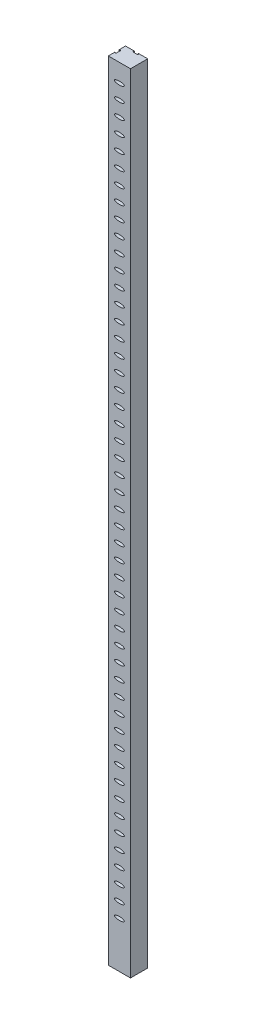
ISO-10303-21;
HEADER;
FILE_DESCRIPTION(('STEP AP214'),'2;1');
FILE_NAME('part.step','',(''),(''),'','','');
FILE_SCHEMA(('AUTOMOTIVE_DESIGN { 1 0 10303 214 1 1 1 1 }'));
ENDSEC;
DATA;
#1=APPLICATION_CONTEXT('core data for automotive mechanical design processes');
#2=APPLICATION_PROTOCOL_DEFINITION('international standard','automotive_design',2000,#1);
#3=PRODUCT_CONTEXT('',#1,'mechanical');
#4=PRODUCT('Part','Part','',(#3));
#5=PRODUCT_RELATED_PRODUCT_CATEGORY('part','',(#4));
#6=PRODUCT_DEFINITION_FORMATION('','',#4);
#7=PRODUCT_DEFINITION_CONTEXT('part definition',#1,'design');
#8=PRODUCT_DEFINITION('design','',#6,#7);
#9=PRODUCT_DEFINITION_SHAPE('','',#8);
#10=(LENGTH_UNIT() NAMED_UNIT(*) SI_UNIT(.MILLI.,.METRE.));
#11=(NAMED_UNIT(*) PLANE_ANGLE_UNIT() SI_UNIT($,.RADIAN.));
#12=(NAMED_UNIT(*) SI_UNIT($,.STERADIAN.) SOLID_ANGLE_UNIT());
#13=UNCERTAINTY_MEASURE_WITH_UNIT(LENGTH_MEASURE(1.E-05),#10,'distance_accuracy_value','');
#14=(GEOMETRIC_REPRESENTATION_CONTEXT(3) GLOBAL_UNCERTAINTY_ASSIGNED_CONTEXT((#13)) GLOBAL_UNIT_ASSIGNED_CONTEXT((#10,
#11,#12)) REPRESENTATION_CONTEXT('',''));
#15=CARTESIAN_POINT('',(0.,0.,0.));
#16=DIRECTION('',(0.,0.,1.));
#17=DIRECTION('',(1.,0.,0.));
#18=AXIS2_PLACEMENT_3D('',#15,#16,#17);
#19=CARTESIAN_POINT('',(4.,1600.,-17.5));
#20=DIRECTION('',(0.,0.,1.));
#21=DIRECTION('',(1.,0.,0.));
#22=AXIS2_PLACEMENT_3D('',#19,#20,#21);
#23=PLANE('',#22);
#24=DIRECTION('',(-1.,0.,0.));
#25=VECTOR('',#24,1.);
#26=CARTESIAN_POINT('',(4.,0.,-17.5));
#27=LINE('',#26,#25);
#28=CARTESIAN_POINT('',(22.5,0.,-17.5));
#29=VERTEX_POINT('',#28);
#30=CARTESIAN_POINT('',(4.,0.,-17.5));
#31=VERTEX_POINT('',#30);
#32=EDGE_CURVE('E227',#29,#31,#27,.T.);
#33=ORIENTED_EDGE('',*,*,#32,.T.);
#34=DIRECTION('',(0.,-1.,0.));
#35=VECTOR('',#34,1.);
#36=CARTESIAN_POINT('',(4.,1600.,-17.5));
#37=LINE('',#36,#35);
#38=CARTESIAN_POINT('',(4.,1600.,-17.5));
#39=VERTEX_POINT('',#38);
#40=EDGE_CURVE('E335',#39,#31,#37,.T.);
#41=ORIENTED_EDGE('',*,*,#40,.F.);
#42=DIRECTION('',(-1.,0.,0.));
#43=VECTOR('',#42,1.);
#44=CARTESIAN_POINT('',(4.,1600.,-17.5));
#45=LINE('',#44,#43);
#46=CARTESIAN_POINT('',(22.5,1600.,-17.5));
#47=VERTEX_POINT('',#46);
#48=EDGE_CURVE('E274',#47,#39,#45,.T.);
#49=ORIENTED_EDGE('',*,*,#48,.F.);
#50=DIRECTION('',(0.,-1.,0.));
#51=VECTOR('',#50,1.);
#52=CARTESIAN_POINT('',(22.5,1600.,-17.5));
#53=LINE('',#52,#51);
#54=EDGE_CURVE('E223',#47,#29,#53,.T.);
#55=ORIENTED_EDGE('',*,*,#54,.T.);
#56=EDGE_LOOP('',(#33,#41,#49,#55));
#57=FACE_BOUND('',#56,.T.);
#58=ADVANCED_FACE('F32',(#57),#23,.F.);
#59=CARTESIAN_POINT('',(4.,1600.,-16.5));
#60=DIRECTION('',(1.,0.,0.));
#61=DIRECTION('',(0.,0.,-1.));
#62=AXIS2_PLACEMENT_3D('',#59,#60,#61);
#63=PLANE('',#62);
#64=DIRECTION('',(0.,0.,1.));
#65=VECTOR('',#64,1.);
#66=CARTESIAN_POINT('',(4.,0.,-16.5));
#67=LINE('',#66,#65);
#68=CARTESIAN_POINT('',(4.,0.,-16.5));
#69=VERTEX_POINT('',#68);
#70=EDGE_CURVE('E230',#31,#69,#67,.T.);
#71=ORIENTED_EDGE('',*,*,#70,.T.);
#72=DIRECTION('',(0.,-1.,0.));
#73=VECTOR('',#72,1.);
#74=CARTESIAN_POINT('',(4.,1600.,-16.5));
#75=LINE('',#74,#73);
#76=CARTESIAN_POINT('',(4.,1600.,-16.5));
#77=VERTEX_POINT('',#76);
#78=EDGE_CURVE('E332',#77,#69,#75,.T.);
#79=ORIENTED_EDGE('',*,*,#78,.F.);
#80=DIRECTION('',(0.,0.,1.));
#81=VECTOR('',#80,1.);
#82=CARTESIAN_POINT('',(4.,1600.,-16.5));
#83=LINE('',#82,#81);
#84=EDGE_CURVE('E141',#39,#77,#83,.T.);
#85=ORIENTED_EDGE('',*,*,#84,.F.);
#86=ORIENTED_EDGE('',*,*,#40,.T.);
#87=EDGE_LOOP('',(#71,#79,#85,#86));
#88=FACE_BOUND('',#87,.T.);
#89=ADVANCED_FACE('F986',(#88),#63,.F.);
#90=CARTESIAN_POINT('',(5.,1600.,-16.5));
#91=DIRECTION('',(0.,0.,-1.));
#92=DIRECTION('',(-1.,0.,0.));
#93=AXIS2_PLACEMENT_3D('',#90,#91,#92);
#94=PLANE('',#93);
#95=DIRECTION('',(1.,0.,0.));
#96=VECTOR('',#95,1.);
#97=CARTESIAN_POINT('',(5.,0.,-16.5));
#98=LINE('',#97,#96);
#99=CARTESIAN_POINT('',(5.,0.,-16.5));
#100=VERTEX_POINT('',#99);
#101=EDGE_CURVE('E233',#69,#100,#98,.T.);
#102=ORIENTED_EDGE('',*,*,#101,.T.);
#103=DIRECTION('',(0.,-1.,0.));
#104=VECTOR('',#103,1.);
#105=CARTESIAN_POINT('',(5.,1600.,-16.5));
#106=LINE('',#105,#104);
#107=CARTESIAN_POINT('',(5.,1600.,-16.5));
#108=VERTEX_POINT('',#107);
#109=EDGE_CURVE('E329',#108,#100,#106,.T.);
#110=ORIENTED_EDGE('',*,*,#109,.F.);
#111=DIRECTION('',(1.,0.,0.));
#112=VECTOR('',#111,1.);
#113=CARTESIAN_POINT('',(5.,1600.,-16.5));
#114=LINE('',#113,#112);
#115=EDGE_CURVE('E1002',#77,#108,#114,.T.);
#116=ORIENTED_EDGE('',*,*,#115,.F.);
#117=ORIENTED_EDGE('',*,*,#78,.T.);
#118=EDGE_LOOP('',(#102,#110,#116,#117));
#119=FACE_BOUND('',#118,.T.);
#120=ADVANCED_FACE('F991',(#119),#94,.F.);
#121=CARTESIAN_POINT('',(5.,1600.,-15.4999999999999));
#122=DIRECTION('',(1.,0.,0.));
#123=DIRECTION('',(0.,0.,-1.));
#124=AXIS2_PLACEMENT_3D('',#121,#122,#123);
#125=PLANE('',#124);
#126=DIRECTION('',(0.,0.,1.));
#127=VECTOR('',#126,1.);
#128=CARTESIAN_POINT('',(5.,0.,-15.4999999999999));
#129=LINE('',#128,#127);
#130=CARTESIAN_POINT('',(5.,0.,-15.4999999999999));
#131=VERTEX_POINT('',#130);
#132=EDGE_CURVE('E235',#100,#131,#129,.T.);
#133=ORIENTED_EDGE('',*,*,#132,.T.);
#134=DIRECTION('',(0.,-1.,0.));
#135=VECTOR('',#134,1.);
#136=CARTESIAN_POINT('',(5.,1600.,-15.4999999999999));
#137=LINE('',#136,#135);
#138=CARTESIAN_POINT('',(5.,1600.,-15.4999999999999));
#139=VERTEX_POINT('',#138);
#140=EDGE_CURVE('E326',#139,#131,#137,.T.);
#141=ORIENTED_EDGE('',*,*,#140,.F.);
#142=DIRECTION('',(0.,0.,1.));
#143=VECTOR('',#142,1.);
#144=CARTESIAN_POINT('',(5.,1600.,-15.4999999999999));
#145=LINE('',#144,#143);
#146=EDGE_CURVE('E1004',#108,#139,#145,.T.);
#147=ORIENTED_EDGE('',*,*,#146,.F.);
#148=ORIENTED_EDGE('',*,*,#109,.T.);
#149=EDGE_LOOP('',(#133,#141,#147,#148));
#150=FACE_BOUND('',#149,.T.);
#151=ADVANCED_FACE('F1126',(#150),#125,.F.);
#152=CARTESIAN_POINT('',(4.,1600.,-14.5));
#153=DIRECTION('',(0.707106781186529,0.,0.707106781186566));
#154=DIRECTION('',(0.707106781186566,0.,-0.707106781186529));
#155=AXIS2_PLACEMENT_3D('',#152,#153,#154);
#156=PLANE('',#155);
#157=DIRECTION('',(-0.707106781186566,0.,0.707106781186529));
#158=VECTOR('',#157,1.);
#159=CARTESIAN_POINT('',(4.,0.,-14.5));
#160=LINE('',#159,#158);
#161=CARTESIAN_POINT('',(4.,0.,-14.5));
#162=VERTEX_POINT('',#161);
#163=EDGE_CURVE('E237',#131,#162,#160,.T.);
#164=ORIENTED_EDGE('',*,*,#163,.T.);
#165=DIRECTION('',(0.,-1.,0.));
#166=VECTOR('',#165,1.);
#167=CARTESIAN_POINT('',(4.,1600.,-14.5));
#168=LINE('',#167,#166);
#169=CARTESIAN_POINT('',(4.,1600.,-14.5));
#170=VERTEX_POINT('',#169);
#171=EDGE_CURVE('E323',#170,#162,#168,.T.);
#172=ORIENTED_EDGE('',*,*,#171,.F.);
#173=DIRECTION('',(-0.707106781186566,0.,0.707106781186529));
#174=VECTOR('',#173,1.);
#175=CARTESIAN_POINT('',(4.,1600.,-14.5));
#176=LINE('',#175,#174);
#177=EDGE_CURVE('E1006',#139,#170,#176,.T.);
#178=ORIENTED_EDGE('',*,*,#177,.F.);
#179=ORIENTED_EDGE('',*,*,#140,.T.);
#180=EDGE_LOOP('',(#164,#172,#178,#179));
#181=FACE_BOUND('',#180,.T.);
#182=ADVANCED_FACE('F1123',(#181),#156,.F.);
#183=CARTESIAN_POINT('',(-4.,1600.,-14.5));
#184=DIRECTION('',(0.,0.,1.));
#185=DIRECTION('',(1.,0.,0.));
#186=AXIS2_PLACEMENT_3D('',#183,#184,#185);
#187=PLANE('',#186);
#188=DIRECTION('',(-1.,0.,0.));
#189=VECTOR('',#188,1.);
#190=CARTESIAN_POINT('',(-4.,0.,-14.5));
#191=LINE('',#190,#189);
#192=CARTESIAN_POINT('',(-4.,0.,-14.5));
#193=VERTEX_POINT('',#192);
#194=EDGE_CURVE('E239',#162,#193,#191,.T.);
#195=ORIENTED_EDGE('',*,*,#194,.T.);
#196=DIRECTION('',(0.,-1.,0.));
#197=VECTOR('',#196,1.);
#198=CARTESIAN_POINT('',(-4.,1600.,-14.5));
#199=LINE('',#198,#197);
#200=CARTESIAN_POINT('',(-4.,1600.,-14.5));
#201=VERTEX_POINT('',#200);
#202=EDGE_CURVE('E320',#201,#193,#199,.T.);
#203=ORIENTED_EDGE('',*,*,#202,.F.);
#204=DIRECTION('',(-1.,0.,0.));
#205=VECTOR('',#204,1.);
#206=CARTESIAN_POINT('',(-4.,1600.,-14.5));
#207=LINE('',#206,#205);
#208=EDGE_CURVE('E1012',#170,#201,#207,.T.);
#209=ORIENTED_EDGE('',*,*,#208,.F.);
#210=ORIENTED_EDGE('',*,*,#171,.T.);
#211=EDGE_LOOP('',(#195,#203,#209,#210));
#212=FACE_BOUND('',#211,.T.);
#213=ADVANCED_FACE('F1119',(#212),#187,.F.);
#214=CARTESIAN_POINT('',(-5.,1600.,-15.5));
#215=DIRECTION('',(-0.707106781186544,0.,0.707106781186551));
#216=DIRECTION('',(0.707106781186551,0.,0.707106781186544));
#217=AXIS2_PLACEMENT_3D('',#214,#215,#216);
#218=PLANE('',#217);
#219=DIRECTION('',(-0.707106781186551,0.,-0.707106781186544));
#220=VECTOR('',#219,1.);
#221=CARTESIAN_POINT('',(-5.,0.,-15.5));
#222=LINE('',#221,#220);
#223=CARTESIAN_POINT('',(-5.,0.,-15.5));
#224=VERTEX_POINT('',#223);
#225=EDGE_CURVE('E241',#193,#224,#222,.T.);
#226=ORIENTED_EDGE('',*,*,#225,.T.);
#227=DIRECTION('',(0.,-1.,0.));
#228=VECTOR('',#227,1.);
#229=CARTESIAN_POINT('',(-5.,1600.,-15.5));
#230=LINE('',#229,#228);
#231=CARTESIAN_POINT('',(-5.,1600.,-15.5));
#232=VERTEX_POINT('',#231);
#233=EDGE_CURVE('E317',#232,#224,#230,.T.);
#234=ORIENTED_EDGE('',*,*,#233,.F.);
#235=DIRECTION('',(-0.707106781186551,0.,-0.707106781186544));
#236=VECTOR('',#235,1.);
#237=CARTESIAN_POINT('',(-5.,1600.,-15.5));
#238=LINE('',#237,#236);
#239=EDGE_CURVE('E1014',#201,#232,#238,.T.);
#240=ORIENTED_EDGE('',*,*,#239,.F.);
#241=ORIENTED_EDGE('',*,*,#202,.T.);
#242=EDGE_LOOP('',(#226,#234,#240,#241));
#243=FACE_BOUND('',#242,.T.);
#244=ADVANCED_FACE('F1114',(#243),#218,.F.);
#245=CARTESIAN_POINT('',(-5.,1600.,-16.5));
#246=DIRECTION('',(-1.,0.,0.));
#247=DIRECTION('',(0.,0.,1.));
#248=AXIS2_PLACEMENT_3D('',#245,#246,#247);
#249=PLANE('',#248);
#250=DIRECTION('',(0.,0.,-1.));
#251=VECTOR('',#250,1.);
#252=CARTESIAN_POINT('',(-5.,0.,-16.5));
#253=LINE('',#252,#251);
#254=CARTESIAN_POINT('',(-5.,0.,-16.5));
#255=VERTEX_POINT('',#254);
#256=EDGE_CURVE('E243',#224,#255,#253,.T.);
#257=ORIENTED_EDGE('',*,*,#256,.T.);
#258=DIRECTION('',(0.,-1.,0.));
#259=VECTOR('',#258,1.);
#260=CARTESIAN_POINT('',(-5.,1600.,-16.5));
#261=LINE('',#260,#259);
#262=CARTESIAN_POINT('',(-5.,1600.,-16.5));
#263=VERTEX_POINT('',#262);
#264=EDGE_CURVE('E314',#263,#255,#261,.T.);
#265=ORIENTED_EDGE('',*,*,#264,.F.);
#266=DIRECTION('',(0.,0.,-1.));
#267=VECTOR('',#266,1.);
#268=CARTESIAN_POINT('',(-5.,1600.,-16.5));
#269=LINE('',#268,#267);
#270=EDGE_CURVE('E1016',#232,#263,#269,.T.);
#271=ORIENTED_EDGE('',*,*,#270,.F.);
#272=ORIENTED_EDGE('',*,*,#233,.T.);
#273=EDGE_LOOP('',(#257,#265,#271,#272));
#274=FACE_BOUND('',#273,.T.);
#275=ADVANCED_FACE('F1108',(#274),#249,.F.);
#276=CARTESIAN_POINT('',(-4.,1600.,-16.5));
#277=DIRECTION('',(0.,0.,-1.));
#278=DIRECTION('',(-1.,0.,0.));
#279=AXIS2_PLACEMENT_3D('',#276,#277,#278);
#280=PLANE('',#279);
#281=DIRECTION('',(1.,0.,0.));
#282=VECTOR('',#281,1.);
#283=CARTESIAN_POINT('',(-4.,0.,-16.5));
#284=LINE('',#283,#282);
#285=CARTESIAN_POINT('',(-4.,0.,-16.5));
#286=VERTEX_POINT('',#285);
#287=EDGE_CURVE('E245',#255,#286,#284,.T.);
#288=ORIENTED_EDGE('',*,*,#287,.T.);
#289=DIRECTION('',(0.,-1.,0.));
#290=VECTOR('',#289,1.);
#291=CARTESIAN_POINT('',(-4.,1600.,-16.5));
#292=LINE('',#291,#290);
#293=CARTESIAN_POINT('',(-4.,1600.,-16.5));
#294=VERTEX_POINT('',#293);
#295=EDGE_CURVE('E311',#294,#286,#292,.T.);
#296=ORIENTED_EDGE('',*,*,#295,.F.);
#297=DIRECTION('',(1.,0.,0.));
#298=VECTOR('',#297,1.);
#299=CARTESIAN_POINT('',(-4.,1600.,-16.5));
#300=LINE('',#299,#298);
#301=EDGE_CURVE('E1018',#263,#294,#300,.T.);
#302=ORIENTED_EDGE('',*,*,#301,.F.);
#303=ORIENTED_EDGE('',*,*,#264,.T.);
#304=EDGE_LOOP('',(#288,#296,#302,#303));
#305=FACE_BOUND('',#304,.T.);
#306=ADVANCED_FACE('F1104',(#305),#280,.F.);
#307=CARTESIAN_POINT('',(-4.,1600.,-17.5));
#308=DIRECTION('',(-1.,0.,0.));
#309=DIRECTION('',(0.,0.,1.));
#310=AXIS2_PLACEMENT_3D('',#307,#308,#309);
#311=PLANE('',#310);
#312=DIRECTION('',(0.,0.,-1.));
#313=VECTOR('',#312,1.);
#314=CARTESIAN_POINT('',(-4.,0.,-17.5));
#315=LINE('',#314,#313);
#316=CARTESIAN_POINT('',(-4.,0.,-17.5));
#317=VERTEX_POINT('',#316);
#318=EDGE_CURVE('E247',#286,#317,#315,.T.);
#319=ORIENTED_EDGE('',*,*,#318,.T.);
#320=DIRECTION('',(0.,-1.,0.));
#321=VECTOR('',#320,1.);
#322=CARTESIAN_POINT('',(-4.,1600.,-17.5));
#323=LINE('',#322,#321);
#324=CARTESIAN_POINT('',(-4.,1600.,-17.5));
#325=VERTEX_POINT('',#324);
#326=EDGE_CURVE('E308',#325,#317,#323,.T.);
#327=ORIENTED_EDGE('',*,*,#326,.F.);
#328=DIRECTION('',(0.,0.,-1.));
#329=VECTOR('',#328,1.);
#330=CARTESIAN_POINT('',(-4.,1600.,-17.5));
#331=LINE('',#330,#329);
#332=EDGE_CURVE('E1020',#294,#325,#331,.T.);
#333=ORIENTED_EDGE('',*,*,#332,.F.);
#334=ORIENTED_EDGE('',*,*,#295,.T.);
#335=EDGE_LOOP('',(#319,#327,#333,#334));
#336=FACE_BOUND('',#335,.T.);
#337=ADVANCED_FACE('F1099',(#336),#311,.F.);
#338=CARTESIAN_POINT('',(-22.5,1600.,-17.5));
#339=DIRECTION('',(0.,0.,1.));
#340=DIRECTION('',(1.,0.,0.));
#341=AXIS2_PLACEMENT_3D('',#338,#339,#340);
#342=PLANE('',#341);
#343=DIRECTION('',(-1.,0.,0.));
#344=VECTOR('',#343,1.);
#345=CARTESIAN_POINT('',(-22.5,0.,-17.5));
#346=LINE('',#345,#344);
#347=CARTESIAN_POINT('',(-22.5,0.,-17.5));
#348=VERTEX_POINT('',#347);
#349=EDGE_CURVE('E249',#317,#348,#346,.T.);
#350=ORIENTED_EDGE('',*,*,#349,.T.);
#351=DIRECTION('',(0.,-1.,0.));
#352=VECTOR('',#351,1.);
#353=CARTESIAN_POINT('',(-22.5,1600.,-17.5));
#354=LINE('',#353,#352);
#355=CARTESIAN_POINT('',(-22.5,1600.,-17.5));
#356=VERTEX_POINT('',#355);
#357=EDGE_CURVE('E305',#356,#348,#354,.T.);
#358=ORIENTED_EDGE('',*,*,#357,.F.);
#359=DIRECTION('',(-1.,0.,0.));
#360=VECTOR('',#359,1.);
#361=CARTESIAN_POINT('',(-22.5,1600.,-17.5));
#362=LINE('',#361,#360);
#363=EDGE_CURVE('E1022',#325,#356,#362,.T.);
#364=ORIENTED_EDGE('',*,*,#363,.F.);
#365=ORIENTED_EDGE('',*,*,#326,.T.);
#366=EDGE_LOOP('',(#350,#358,#364,#365));
#367=FACE_BOUND('',#366,.T.);
#368=ADVANCED_FACE('F1093',(#367),#342,.F.);
#369=CARTESIAN_POINT('',(-22.5,1600.,-4.));
#370=DIRECTION('',(1.,0.,0.));
#371=DIRECTION('',(0.,0.,-1.));
#372=AXIS2_PLACEMENT_3D('',#369,#370,#371);
#373=PLANE('',#372);
#374=DIRECTION('',(0.,0.,1.));
#375=VECTOR('',#374,1.);
#376=CARTESIAN_POINT('',(-22.5,0.,-4.));
#377=LINE('',#376,#375);
#378=CARTESIAN_POINT('',(-22.5,0.,-4.));
#379=VERTEX_POINT('',#378);
#380=EDGE_CURVE('E251',#348,#379,#377,.T.);
#381=ORIENTED_EDGE('',*,*,#380,.T.);
#382=DIRECTION('',(0.,-1.,0.));
#383=VECTOR('',#382,1.);
#384=CARTESIAN_POINT('',(-22.5,1600.,-4.));
#385=LINE('',#384,#383);
#386=CARTESIAN_POINT('',(-22.5,1600.,-4.));
#387=VERTEX_POINT('',#386);
#388=EDGE_CURVE('E302',#387,#379,#385,.T.);
#389=ORIENTED_EDGE('',*,*,#388,.F.);
#390=DIRECTION('',(0.,0.,1.));
#391=VECTOR('',#390,1.);
#392=CARTESIAN_POINT('',(-22.5,1600.,-4.));
#393=LINE('',#392,#391);
#394=EDGE_CURVE('E1024',#356,#387,#393,.T.);
#395=ORIENTED_EDGE('',*,*,#394,.F.);
#396=ORIENTED_EDGE('',*,*,#357,.T.);
#397=EDGE_LOOP('',(#381,#389,#395,#396));
#398=FACE_BOUND('',#397,.T.);
#399=ADVANCED_FACE('F1089',(#398),#373,.F.);
#400=CARTESIAN_POINT('',(-22.5,1600.,-4.));
#401=DIRECTION('',(0.,0.,-1.));
#402=DIRECTION('',(-1.,0.,0.));
#403=AXIS2_PLACEMENT_3D('',#400,#401,#402);
#404=PLANE('',#403);
#405=DIRECTION('',(1.,0.,0.));
#406=VECTOR('',#405,1.);
#407=CARTESIAN_POINT('',(-22.5,0.,-4.));
#408=LINE('',#407,#406);
#409=CARTESIAN_POINT('',(-21.5,0.,-4.));
#410=VERTEX_POINT('',#409);
#411=EDGE_CURVE('E253',#379,#410,#408,.T.);
#412=ORIENTED_EDGE('',*,*,#411,.T.);
#413=DIRECTION('',(0.,-1.,0.));
#414=VECTOR('',#413,1.);
#415=CARTESIAN_POINT('',(-21.5,1600.,-4.));
#416=LINE('',#415,#414);
#417=CARTESIAN_POINT('',(-21.5,1600.,-4.));
#418=VERTEX_POINT('',#417);
#419=EDGE_CURVE('E299',#418,#410,#416,.T.);
#420=ORIENTED_EDGE('',*,*,#419,.F.);
#421=DIRECTION('',(1.,0.,0.));
#422=VECTOR('',#421,1.);
#423=CARTESIAN_POINT('',(-22.5,1600.,-4.));
#424=LINE('',#423,#422);
#425=EDGE_CURVE('E1026',#387,#418,#424,.T.);
#426=ORIENTED_EDGE('',*,*,#425,.F.);
#427=ORIENTED_EDGE('',*,*,#388,.T.);
#428=EDGE_LOOP('',(#412,#420,#426,#427));
#429=FACE_BOUND('',#428,.T.);
#430=ADVANCED_FACE('F1084',(#429),#404,.F.);
#431=CARTESIAN_POINT('',(-21.5,1600.,-4.));
#432=DIRECTION('',(-1.,0.,0.));
#433=DIRECTION('',(0.,0.,1.));
#434=AXIS2_PLACEMENT_3D('',#431,#432,#433);
#435=PLANE('',#434);
#436=DIRECTION('',(0.,0.,-1.));
#437=VECTOR('',#436,1.);
#438=CARTESIAN_POINT('',(-21.5,0.,-4.));
#439=LINE('',#438,#437);
#440=CARTESIAN_POINT('',(-21.5,0.,-5.));
#441=VERTEX_POINT('',#440);
#442=EDGE_CURVE('E255',#410,#441,#439,.T.);
#443=ORIENTED_EDGE('',*,*,#442,.T.);
#444=DIRECTION('',(0.,-1.,0.));
#445=VECTOR('',#444,1.);
#446=CARTESIAN_POINT('',(-21.5,1600.,-5.));
#447=LINE('',#446,#445);
#448=CARTESIAN_POINT('',(-21.5,1600.,-5.));
#449=VERTEX_POINT('',#448);
#450=EDGE_CURVE('E296',#449,#441,#447,.T.);
#451=ORIENTED_EDGE('',*,*,#450,.F.);
#452=DIRECTION('',(0.,0.,-1.));
#453=VECTOR('',#452,1.);
#454=CARTESIAN_POINT('',(-21.5,1600.,-4.));
#455=LINE('',#454,#453);
#456=EDGE_CURVE('E1028',#418,#449,#455,.T.);
#457=ORIENTED_EDGE('',*,*,#456,.F.);
#458=ORIENTED_EDGE('',*,*,#419,.T.);
#459=EDGE_LOOP('',(#443,#451,#457,#458));
#460=FACE_BOUND('',#459,.T.);
#461=ADVANCED_FACE('F1078',(#460),#435,.F.);
#462=CARTESIAN_POINT('',(-21.5,1600.,-5.));
#463=DIRECTION('',(0.,0.,-1.));
#464=DIRECTION('',(-1.,0.,0.));
#465=AXIS2_PLACEMENT_3D('',#462,#463,#464);
#466=PLANE('',#465);
#467=DIRECTION('',(1.,0.,0.));
#468=VECTOR('',#467,1.);
#469=CARTESIAN_POINT('',(-21.5,0.,-5.));
#470=LINE('',#469,#468);
#471=CARTESIAN_POINT('',(-20.5,0.,-5.));
#472=VERTEX_POINT('',#471);
#473=EDGE_CURVE('E257',#441,#472,#470,.T.);
#474=ORIENTED_EDGE('',*,*,#473,.T.);
#475=DIRECTION('',(0.,-1.,0.));
#476=VECTOR('',#475,1.);
#477=CARTESIAN_POINT('',(-20.5,1600.,-5.));
#478=LINE('',#477,#476);
#479=CARTESIAN_POINT('',(-20.5,1600.,-5.));
#480=VERTEX_POINT('',#479);
#481=EDGE_CURVE('E293',#480,#472,#478,.T.);
#482=ORIENTED_EDGE('',*,*,#481,.F.);
#483=DIRECTION('',(1.,0.,0.));
#484=VECTOR('',#483,1.);
#485=CARTESIAN_POINT('',(-21.5,1600.,-5.));
#486=LINE('',#485,#484);
#487=EDGE_CURVE('E1030',#449,#480,#486,.T.);
#488=ORIENTED_EDGE('',*,*,#487,.F.);
#489=ORIENTED_EDGE('',*,*,#450,.T.);
#490=EDGE_LOOP('',(#474,#482,#488,#489));
#491=FACE_BOUND('',#490,.T.);
#492=ADVANCED_FACE('F1074',(#491),#466,.F.);
#493=CARTESIAN_POINT('',(-20.5,1600.,-5.));
#494=DIRECTION('',(0.707106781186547,0.,-0.707106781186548));
#495=DIRECTION('',(-0.707106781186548,0.,-0.707106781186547));
#496=AXIS2_PLACEMENT_3D('',#493,#494,#495);
#497=PLANE('',#496);
#498=DIRECTION('',(0.707106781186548,0.,0.707106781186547));
#499=VECTOR('',#498,1.);
#500=CARTESIAN_POINT('',(-20.5,0.,-5.));
#501=LINE('',#500,#499);
#502=CARTESIAN_POINT('',(-19.5,0.,-4.));
#503=VERTEX_POINT('',#502);
#504=EDGE_CURVE('E259',#472,#503,#501,.T.);
#505=ORIENTED_EDGE('',*,*,#504,.T.);
#506=DIRECTION('',(0.,-1.,0.));
#507=VECTOR('',#506,1.);
#508=CARTESIAN_POINT('',(-19.5,1600.,-4.));
#509=LINE('',#508,#507);
#510=CARTESIAN_POINT('',(-19.5,1600.,-4.));
#511=VERTEX_POINT('',#510);
#512=EDGE_CURVE('E290',#511,#503,#509,.T.);
#513=ORIENTED_EDGE('',*,*,#512,.F.);
#514=DIRECTION('',(0.707106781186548,0.,0.707106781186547));
#515=VECTOR('',#514,1.);
#516=CARTESIAN_POINT('',(-20.5,1600.,-5.));
#517=LINE('',#516,#515);
#518=EDGE_CURVE('E1032',#480,#511,#517,.T.);
#519=ORIENTED_EDGE('',*,*,#518,.F.);
#520=ORIENTED_EDGE('',*,*,#481,.T.);
#521=EDGE_LOOP('',(#505,#513,#519,#520));
#522=FACE_BOUND('',#521,.T.);
#523=ADVANCED_FACE('F1069',(#522),#497,.F.);
#524=CARTESIAN_POINT('',(-19.5,1600.,-4.));
#525=DIRECTION('',(1.,0.,0.));
#526=DIRECTION('',(0.,0.,-1.));
#527=AXIS2_PLACEMENT_3D('',#524,#525,#526);
#528=PLANE('',#527);
#529=DIRECTION('',(0.,0.,1.));
#530=VECTOR('',#529,1.);
#531=CARTESIAN_POINT('',(-19.5,0.,-4.));
#532=LINE('',#531,#530);
#533=CARTESIAN_POINT('',(-19.5,0.,3.99999999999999));
#534=VERTEX_POINT('',#533);
#535=EDGE_CURVE('E261',#503,#534,#532,.T.);
#536=ORIENTED_EDGE('',*,*,#535,.T.);
#537=DIRECTION('',(0.,-1.,0.));
#538=VECTOR('',#537,1.);
#539=CARTESIAN_POINT('',(-19.5,1600.,3.99999999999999));
#540=LINE('',#539,#538);
#541=CARTESIAN_POINT('',(-19.5,1600.,3.99999999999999));
#542=VERTEX_POINT('',#541);
#543=EDGE_CURVE('E287',#542,#534,#540,.T.);
#544=ORIENTED_EDGE('',*,*,#543,.F.);
#545=DIRECTION('',(0.,0.,1.));
#546=VECTOR('',#545,1.);
#547=CARTESIAN_POINT('',(-19.5,1600.,-4.));
#548=LINE('',#547,#546);
#549=EDGE_CURVE('E1034',#511,#542,#548,.T.);
#550=ORIENTED_EDGE('',*,*,#549,.F.);
#551=ORIENTED_EDGE('',*,*,#512,.T.);
#552=EDGE_LOOP('',(#536,#544,#550,#551));
#553=FACE_BOUND('',#552,.T.);
#554=ADVANCED_FACE('F1063',(#553),#528,.F.);
#555=CARTESIAN_POINT('',(-19.5,1600.,3.99999999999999));
#556=DIRECTION('',(0.707106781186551,0.,0.707106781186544));
#557=DIRECTION('',(0.707106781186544,0.,-0.707106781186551));
#558=AXIS2_PLACEMENT_3D('',#555,#556,#557);
#559=PLANE('',#558);
#560=DIRECTION('',(-0.707106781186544,0.,0.70710678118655));
#561=VECTOR('',#560,1.);
#562=CARTESIAN_POINT('',(-19.5,0.,3.99999999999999));
#563=LINE('',#562,#561);
#564=CARTESIAN_POINT('',(-20.5,0.,5.));
#565=VERTEX_POINT('',#564);
#566=EDGE_CURVE('E263',#534,#565,#563,.T.);
#567=ORIENTED_EDGE('',*,*,#566,.T.);
#568=DIRECTION('',(0.,-1.,0.));
#569=VECTOR('',#568,1.);
#570=CARTESIAN_POINT('',(-20.5,1600.,5.));
#571=LINE('',#570,#569);
#572=CARTESIAN_POINT('',(-20.5,1600.,5.));
#573=VERTEX_POINT('',#572);
#574=EDGE_CURVE('E284',#573,#565,#571,.T.);
#575=ORIENTED_EDGE('',*,*,#574,.F.);
#576=DIRECTION('',(-0.707106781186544,0.,0.70710678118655));
#577=VECTOR('',#576,1.);
#578=CARTESIAN_POINT('',(-19.5,1600.,3.99999999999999));
#579=LINE('',#578,#577);
#580=EDGE_CURVE('E1036',#542,#573,#579,.T.);
#581=ORIENTED_EDGE('',*,*,#580,.F.);
#582=ORIENTED_EDGE('',*,*,#543,.T.);
#583=EDGE_LOOP('',(#567,#575,#581,#582));
#584=FACE_BOUND('',#583,.T.);
#585=ADVANCED_FACE('F1059',(#584),#559,.F.);
#586=CARTESIAN_POINT('',(-20.5,1600.,5.));
#587=DIRECTION('',(0.,0.,1.));
#588=DIRECTION('',(1.,0.,0.));
#589=AXIS2_PLACEMENT_3D('',#586,#587,#588);
#590=PLANE('',#589);
#591=DIRECTION('',(-1.,0.,0.));
#592=VECTOR('',#591,1.);
#593=CARTESIAN_POINT('',(-20.5,0.,5.));
#594=LINE('',#593,#592);
#595=CARTESIAN_POINT('',(-21.5,0.,5.));
#596=VERTEX_POINT('',#595);
#597=EDGE_CURVE('E265',#565,#596,#594,.T.);
#598=ORIENTED_EDGE('',*,*,#597,.T.);
#599=DIRECTION('',(0.,-1.,0.));
#600=VECTOR('',#599,1.);
#601=CARTESIAN_POINT('',(-21.5,1600.,5.));
#602=LINE('',#601,#600);
#603=CARTESIAN_POINT('',(-21.5,1600.,5.));
#604=VERTEX_POINT('',#603);
#605=EDGE_CURVE('E281',#604,#596,#602,.T.);
#606=ORIENTED_EDGE('',*,*,#605,.F.);
#607=DIRECTION('',(-1.,0.,0.));
#608=VECTOR('',#607,1.);
#609=CARTESIAN_POINT('',(-20.5,1600.,5.));
#610=LINE('',#609,#608);
#611=EDGE_CURVE('E1038',#573,#604,#610,.T.);
#612=ORIENTED_EDGE('',*,*,#611,.F.);
#613=ORIENTED_EDGE('',*,*,#574,.T.);
#614=EDGE_LOOP('',(#598,#606,#612,#613));
#615=FACE_BOUND('',#614,.T.);
#616=ADVANCED_FACE('F1055',(#615),#590,.F.);
#617=CARTESIAN_POINT('',(-21.5,1600.,5.));
#618=DIRECTION('',(-1.,0.,0.));
#619=DIRECTION('',(0.,0.,1.));
#620=AXIS2_PLACEMENT_3D('',#617,#618,#619);
#621=PLANE('',#620);
#622=DIRECTION('',(0.,0.,-1.));
#623=VECTOR('',#622,1.);
#624=CARTESIAN_POINT('',(-21.5,0.,5.));
#625=LINE('',#624,#623);
#626=CARTESIAN_POINT('',(-21.5,0.,4.));
#627=VERTEX_POINT('',#626);
#628=EDGE_CURVE('E267',#596,#627,#625,.T.);
#629=ORIENTED_EDGE('',*,*,#628,.T.);
#630=DIRECTION('',(0.,-1.,0.));
#631=VECTOR('',#630,1.);
#632=CARTESIAN_POINT('',(-21.5,1600.,4.));
#633=LINE('',#632,#631);
#634=CARTESIAN_POINT('',(-21.5,1600.,4.));
#635=VERTEX_POINT('',#634);
#636=EDGE_CURVE('E278',#635,#627,#633,.T.);
#637=ORIENTED_EDGE('',*,*,#636,.F.);
#638=DIRECTION('',(0.,0.,-1.));
#639=VECTOR('',#638,1.);
#640=CARTESIAN_POINT('',(-21.5,1600.,5.));
#641=LINE('',#640,#639);
#642=EDGE_CURVE('E1040',#604,#635,#641,.T.);
#643=ORIENTED_EDGE('',*,*,#642,.F.);
#644=ORIENTED_EDGE('',*,*,#605,.T.);
#645=EDGE_LOOP('',(#629,#637,#643,#644));
#646=FACE_BOUND('',#645,.T.);
#647=ADVANCED_FACE('F1046',(#646),#621,.F.);
#648=CARTESIAN_POINT('',(-21.5,1600.,4.));
#649=DIRECTION('',(0.,0.,1.));
#650=DIRECTION('',(1.,0.,0.));
#651=AXIS2_PLACEMENT_3D('',#648,#649,#650);
#652=PLANE('',#651);
#653=DIRECTION('',(-1.,0.,0.));
#654=VECTOR('',#653,1.);
#655=CARTESIAN_POINT('',(-21.5,0.,4.));
#656=LINE('',#655,#654);
#657=CARTESIAN_POINT('',(-22.5,0.,4.));
#658=VERTEX_POINT('',#657);
#659=EDGE_CURVE('E269',#627,#658,#656,.T.);
#660=ORIENTED_EDGE('',*,*,#659,.T.);
#661=DIRECTION('',(0.,-1.,0.));
#662=VECTOR('',#661,1.);
#663=CARTESIAN_POINT('',(-22.5,1600.,4.));
#664=LINE('',#663,#662);
#665=CARTESIAN_POINT('',(-22.5,1600.,4.));
#666=VERTEX_POINT('',#665);
#667=EDGE_CURVE('E217',#666,#658,#664,.T.);
#668=ORIENTED_EDGE('',*,*,#667,.F.);
#669=DIRECTION('',(-1.,0.,0.));
#670=VECTOR('',#669,1.);
#671=CARTESIAN_POINT('',(-21.5,1600.,4.));
#672=LINE('',#671,#670);
#673=EDGE_CURVE('E208',#635,#666,#672,.T.);
#674=ORIENTED_EDGE('',*,*,#673,.F.);
#675=ORIENTED_EDGE('',*,*,#636,.T.);
#676=EDGE_LOOP('',(#660,#668,#674,#675));
#677=FACE_BOUND('',#676,.T.);
#678=ADVANCED_FACE('F1050',(#677),#652,.F.);
#679=CARTESIAN_POINT('',(-22.5,1600.,4.));
#680=DIRECTION('',(1.,0.,0.));
#681=DIRECTION('',(0.,0.,-1.));
#682=AXIS2_PLACEMENT_3D('',#679,#680,#681);
#683=PLANE('',#682);
#684=DIRECTION('',(0.,0.,1.));
#685=VECTOR('',#684,1.);
#686=CARTESIAN_POINT('',(-22.5,0.,4.));
#687=LINE('',#686,#685);
#688=CARTESIAN_POINT('',(-22.5,0.,17.5));
#689=VERTEX_POINT('',#688);
#690=EDGE_CURVE('E216',#658,#689,#687,.T.);
#691=ORIENTED_EDGE('',*,*,#690,.T.);
#692=DIRECTION('',(0.,-1.,0.));
#693=VECTOR('',#692,1.);
#694=CARTESIAN_POINT('',(-22.5,1600.,17.5));
#695=LINE('',#694,#693);
#696=CARTESIAN_POINT('',(-22.5,1600.,17.5));
#697=VERTEX_POINT('',#696);
#698=EDGE_CURVE('E213',#697,#689,#695,.T.);
#699=ORIENTED_EDGE('',*,*,#698,.F.);
#700=DIRECTION('',(0.,0.,1.));
#701=VECTOR('',#700,1.);
#702=CARTESIAN_POINT('',(-22.5,1600.,4.));
#703=LINE('',#702,#701);
#704=EDGE_CURVE('E202',#666,#697,#703,.T.);
#705=ORIENTED_EDGE('',*,*,#704,.F.);
#706=ORIENTED_EDGE('',*,*,#667,.T.);
#707=EDGE_LOOP('',(#691,#699,#705,#706));
#708=FACE_BOUND('',#707,.T.);
#709=ADVANCED_FACE('F214',(#708),#683,.F.);
#710=CARTESIAN_POINT('',(-22.5,1600.,17.5));
#711=DIRECTION('',(0.,0.,-1.));
#712=DIRECTION('',(-1.,0.,0.));
#713=AXIS2_PLACEMENT_3D('',#710,#711,#712);
#714=PLANE('',#713);
#715=CARTESIAN_POINT('',(-1.92633220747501E-13,1533.5,17.5));
#716=DIRECTION('',(0.,0.,1.));
#717=DIRECTION('',(1.,-1.77635683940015E-13,0.));
#718=AXIS2_PLACEMENT_3D('',#715,#716,#717);
#719=ELLIPSE('',#718,10.0000000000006,3.50000000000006);
#720=CARTESIAN_POINT('',(10.0000000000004,1533.5,17.5));
#721=VERTEX_POINT('',#720);
#722=EDGE_CURVE('E1192',#721,#721,#719,.T.);
#723=ORIENTED_EDGE('',*,*,#722,.F.);
#724=EDGE_LOOP('',(#723));
#725=FACE_BOUND('',#724,.T.);
#726=CARTESIAN_POINT('',(-1.92633220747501E-13,1563.5,17.5));
#727=DIRECTION('',(0.,0.,1.));
#728=DIRECTION('',(1.,-1.77635683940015E-13,0.));
#729=AXIS2_PLACEMENT_3D('',#726,#727,#728);
#730=ELLIPSE('',#729,10.0000000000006,3.50000000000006);
#731=CARTESIAN_POINT('',(10.0000000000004,1563.5,17.5));
#732=VERTEX_POINT('',#731);
#733=EDGE_CURVE('E1191',#732,#732,#730,.T.);
#734=ORIENTED_EDGE('',*,*,#733,.F.);
#735=EDGE_LOOP('',(#734));
#736=FACE_BOUND('',#735,.T.);
#737=DIRECTION('',(1.,0.,0.));
#738=VECTOR('',#737,1.);
#739=CARTESIAN_POINT('',(-22.5,0.,17.5));
#740=LINE('',#739,#738);
#741=CARTESIAN_POINT('',(22.5,0.,17.5));
#742=VERTEX_POINT('',#741);
#743=EDGE_CURVE('E126',#689,#742,#740,.T.);
#744=ORIENTED_EDGE('',*,*,#743,.T.);
#745=DIRECTION('',(0.,-1.,0.));
#746=VECTOR('',#745,1.);
#747=CARTESIAN_POINT('',(22.5,1600.,17.5));
#748=LINE('',#747,#746);
#749=CARTESIAN_POINT('',(22.5,1600.,17.5));
#750=VERTEX_POINT('',#749);
#751=EDGE_CURVE('E218',#750,#742,#748,.T.);
#752=ORIENTED_EDGE('',*,*,#751,.F.);
#753=DIRECTION('',(1.,0.,0.));
#754=VECTOR('',#753,1.);
#755=CARTESIAN_POINT('',(-22.5,1600.,17.5));
#756=LINE('',#755,#754);
#757=EDGE_CURVE('E206',#697,#750,#756,.T.);
#758=ORIENTED_EDGE('',*,*,#757,.F.);
#759=ORIENTED_EDGE('',*,*,#698,.T.);
#760=EDGE_LOOP('',(#744,#752,#758,#759));
#761=FACE_BOUND('',#760,.T.);
#762=CARTESIAN_POINT('',(-1.92633220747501E-13,1503.5,17.5));
#763=DIRECTION('',(0.,0.,1.));
#764=DIRECTION('',(1.,-1.77635683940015E-13,0.));
#765=AXIS2_PLACEMENT_3D('',#762,#763,#764);
#766=ELLIPSE('',#765,10.0000000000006,3.50000000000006);
#767=CARTESIAN_POINT('',(10.0000000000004,1503.5,17.5));
#768=VERTEX_POINT('',#767);
#769=EDGE_CURVE('E337',#768,#768,#766,.T.);
#770=ORIENTED_EDGE('',*,*,#769,.F.);
#771=EDGE_LOOP('',(#770));
#772=FACE_BOUND('',#771,.T.);
#773=CARTESIAN_POINT('',(-1.92633220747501E-13,1473.5,17.5));
#774=DIRECTION('',(0.,0.,1.));
#775=DIRECTION('',(1.,-1.77635683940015E-13,0.));
#776=AXIS2_PLACEMENT_3D('',#773,#774,#775);
#777=ELLIPSE('',#776,10.0000000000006,3.50000000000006);
#778=CARTESIAN_POINT('',(10.0000000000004,1473.5,17.5));
#779=VERTEX_POINT('',#778);
#780=EDGE_CURVE('E342',#779,#779,#777,.T.);
#781=ORIENTED_EDGE('',*,*,#780,.F.);
#782=EDGE_LOOP('',(#781));
#783=FACE_BOUND('',#782,.T.);
#784=CARTESIAN_POINT('',(-1.92633220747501E-13,1443.5,17.5));
#785=DIRECTION('',(0.,0.,1.));
#786=DIRECTION('',(1.,-1.77635683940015E-13,0.));
#787=AXIS2_PLACEMENT_3D('',#784,#785,#786);
#788=ELLIPSE('',#787,10.0000000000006,3.50000000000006);
#789=CARTESIAN_POINT('',(10.0000000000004,1443.5,17.5));
#790=VERTEX_POINT('',#789);
#791=EDGE_CURVE('E368',#790,#790,#788,.T.);
#792=ORIENTED_EDGE('',*,*,#791,.F.);
#793=EDGE_LOOP('',(#792));
#794=FACE_BOUND('',#793,.T.);
#795=CARTESIAN_POINT('',(-1.92633220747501E-13,1413.5,17.5));
#796=DIRECTION('',(0.,0.,1.));
#797=DIRECTION('',(1.,-1.77635683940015E-13,0.));
#798=AXIS2_PLACEMENT_3D('',#795,#796,#797);
#799=ELLIPSE('',#798,10.0000000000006,3.50000000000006);
#800=CARTESIAN_POINT('',(10.0000000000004,1413.5,17.5));
#801=VERTEX_POINT('',#800);
#802=EDGE_CURVE('E375',#801,#801,#799,.T.);
#803=ORIENTED_EDGE('',*,*,#802,.F.);
#804=EDGE_LOOP('',(#803));
#805=FACE_BOUND('',#804,.T.);
#806=CARTESIAN_POINT('',(-1.92633220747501E-13,1383.5,17.5));
#807=DIRECTION('',(0.,0.,1.));
#808=DIRECTION('',(1.,-1.77635683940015E-13,0.));
#809=AXIS2_PLACEMENT_3D('',#806,#807,#808);
#810=ELLIPSE('',#809,10.0000000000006,3.50000000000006);
#811=CARTESIAN_POINT('',(10.0000000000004,1383.5,17.5));
#812=VERTEX_POINT('',#811);
#813=EDGE_CURVE('E395',#812,#812,#810,.T.);
#814=ORIENTED_EDGE('',*,*,#813,.F.);
#815=EDGE_LOOP('',(#814));
#816=FACE_BOUND('',#815,.T.);
#817=CARTESIAN_POINT('',(-1.92633220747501E-13,1353.5,17.5));
#818=DIRECTION('',(0.,0.,1.));
#819=DIRECTION('',(1.,-1.77635683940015E-13,0.));
#820=AXIS2_PLACEMENT_3D('',#817,#818,#819);
#821=ELLIPSE('',#820,10.0000000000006,3.50000000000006);
#822=CARTESIAN_POINT('',(10.0000000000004,1353.5,17.5));
#823=VERTEX_POINT('',#822);
#824=EDGE_CURVE('E402',#823,#823,#821,.T.);
#825=ORIENTED_EDGE('',*,*,#824,.F.);
#826=EDGE_LOOP('',(#825));
#827=FACE_BOUND('',#826,.T.);
#828=CARTESIAN_POINT('',(-1.92633220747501E-13,1323.5,17.5));
#829=DIRECTION('',(0.,0.,1.));
#830=DIRECTION('',(1.,-1.77635683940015E-13,0.));
#831=AXIS2_PLACEMENT_3D('',#828,#829,#830);
#832=ELLIPSE('',#831,10.0000000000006,3.50000000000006);
#833=CARTESIAN_POINT('',(10.0000000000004,1323.5,17.5));
#834=VERTEX_POINT('',#833);
#835=EDGE_CURVE('E422',#834,#834,#832,.T.);
#836=ORIENTED_EDGE('',*,*,#835,.F.);
#837=EDGE_LOOP('',(#836));
#838=FACE_BOUND('',#837,.T.);
#839=CARTESIAN_POINT('',(-1.92633220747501E-13,1293.5,17.5));
#840=DIRECTION('',(0.,0.,1.));
#841=DIRECTION('',(1.,-1.77635683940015E-13,0.));
#842=AXIS2_PLACEMENT_3D('',#839,#840,#841);
#843=ELLIPSE('',#842,10.0000000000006,3.50000000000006);
#844=CARTESIAN_POINT('',(10.0000000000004,1293.5,17.5));
#845=VERTEX_POINT('',#844);
#846=EDGE_CURVE('E429',#845,#845,#843,.T.);
#847=ORIENTED_EDGE('',*,*,#846,.F.);
#848=EDGE_LOOP('',(#847));
#849=FACE_BOUND('',#848,.T.);
#850=CARTESIAN_POINT('',(-1.92633220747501E-13,1263.5,17.5));
#851=DIRECTION('',(0.,0.,1.));
#852=DIRECTION('',(1.,-1.77635683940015E-13,0.));
#853=AXIS2_PLACEMENT_3D('',#850,#851,#852);
#854=ELLIPSE('',#853,10.0000000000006,3.50000000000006);
#855=CARTESIAN_POINT('',(10.0000000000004,1263.5,17.5));
#856=VERTEX_POINT('',#855);
#857=EDGE_CURVE('E449',#856,#856,#854,.T.);
#858=ORIENTED_EDGE('',*,*,#857,.F.);
#859=EDGE_LOOP('',(#858));
#860=FACE_BOUND('',#859,.T.);
#861=CARTESIAN_POINT('',(-1.92633220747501E-13,1233.5,17.5));
#862=DIRECTION('',(0.,0.,1.));
#863=DIRECTION('',(1.,-1.77635683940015E-13,0.));
#864=AXIS2_PLACEMENT_3D('',#861,#862,#863);
#865=ELLIPSE('',#864,10.0000000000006,3.50000000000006);
#866=CARTESIAN_POINT('',(10.0000000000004,1233.5,17.5));
#867=VERTEX_POINT('',#866);
#868=EDGE_CURVE('E456',#867,#867,#865,.T.);
#869=ORIENTED_EDGE('',*,*,#868,.F.);
#870=EDGE_LOOP('',(#869));
#871=FACE_BOUND('',#870,.T.);
#872=CARTESIAN_POINT('',(-1.92633220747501E-13,1203.5,17.5));
#873=DIRECTION('',(0.,0.,1.));
#874=DIRECTION('',(1.,-1.77635683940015E-13,0.));
#875=AXIS2_PLACEMENT_3D('',#872,#873,#874);
#876=ELLIPSE('',#875,10.0000000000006,3.50000000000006);
#877=CARTESIAN_POINT('',(10.0000000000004,1203.5,17.5));
#878=VERTEX_POINT('',#877);
#879=EDGE_CURVE('E476',#878,#878,#876,.T.);
#880=ORIENTED_EDGE('',*,*,#879,.F.);
#881=EDGE_LOOP('',(#880));
#882=FACE_BOUND('',#881,.T.);
#883=CARTESIAN_POINT('',(-1.92633220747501E-13,1173.5,17.5));
#884=DIRECTION('',(0.,0.,1.));
#885=DIRECTION('',(1.,-1.77635683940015E-13,0.));
#886=AXIS2_PLACEMENT_3D('',#883,#884,#885);
#887=ELLIPSE('',#886,10.0000000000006,3.50000000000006);
#888=CARTESIAN_POINT('',(10.0000000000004,1173.5,17.5));
#889=VERTEX_POINT('',#888);
#890=EDGE_CURVE('E483',#889,#889,#887,.T.);
#891=ORIENTED_EDGE('',*,*,#890,.F.);
#892=EDGE_LOOP('',(#891));
#893=FACE_BOUND('',#892,.T.);
#894=CARTESIAN_POINT('',(-1.92633220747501E-13,1143.5,17.5));
#895=DIRECTION('',(0.,0.,1.));
#896=DIRECTION('',(1.,-1.77635683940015E-13,0.));
#897=AXIS2_PLACEMENT_3D('',#894,#895,#896);
#898=ELLIPSE('',#897,10.0000000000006,3.50000000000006);
#899=CARTESIAN_POINT('',(10.0000000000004,1143.5,17.5));
#900=VERTEX_POINT('',#899);
#901=EDGE_CURVE('E503',#900,#900,#898,.T.);
#902=ORIENTED_EDGE('',*,*,#901,.F.);
#903=EDGE_LOOP('',(#902));
#904=FACE_BOUND('',#903,.T.);
#905=CARTESIAN_POINT('',(-1.92633220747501E-13,1113.5,17.5));
#906=DIRECTION('',(0.,0.,1.));
#907=DIRECTION('',(1.,-1.77635683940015E-13,0.));
#908=AXIS2_PLACEMENT_3D('',#905,#906,#907);
#909=ELLIPSE('',#908,10.0000000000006,3.50000000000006);
#910=CARTESIAN_POINT('',(10.0000000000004,1113.5,17.5));
#911=VERTEX_POINT('',#910);
#912=EDGE_CURVE('E510',#911,#911,#909,.T.);
#913=ORIENTED_EDGE('',*,*,#912,.F.);
#914=EDGE_LOOP('',(#913));
#915=FACE_BOUND('',#914,.T.);
#916=CARTESIAN_POINT('',(-1.92633220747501E-13,1083.5,17.5));
#917=DIRECTION('',(0.,0.,1.));
#918=DIRECTION('',(1.,-1.77635683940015E-13,0.));
#919=AXIS2_PLACEMENT_3D('',#916,#917,#918);
#920=ELLIPSE('',#919,10.0000000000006,3.50000000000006);
#921=CARTESIAN_POINT('',(10.0000000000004,1083.5,17.5));
#922=VERTEX_POINT('',#921);
#923=EDGE_CURVE('E530',#922,#922,#920,.T.);
#924=ORIENTED_EDGE('',*,*,#923,.F.);
#925=EDGE_LOOP('',(#924));
#926=FACE_BOUND('',#925,.T.);
#927=CARTESIAN_POINT('',(-1.92633220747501E-13,1053.5,17.5));
#928=DIRECTION('',(0.,0.,1.));
#929=DIRECTION('',(1.,-1.77635683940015E-13,0.));
#930=AXIS2_PLACEMENT_3D('',#927,#928,#929);
#931=ELLIPSE('',#930,10.0000000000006,3.50000000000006);
#932=CARTESIAN_POINT('',(10.0000000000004,1053.5,17.5));
#933=VERTEX_POINT('',#932);
#934=EDGE_CURVE('E537',#933,#933,#931,.T.);
#935=ORIENTED_EDGE('',*,*,#934,.F.);
#936=EDGE_LOOP('',(#935));
#937=FACE_BOUND('',#936,.T.);
#938=CARTESIAN_POINT('',(-1.92633220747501E-13,1023.5,17.5));
#939=DIRECTION('',(0.,0.,1.));
#940=DIRECTION('',(1.,-1.77635683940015E-13,0.));
#941=AXIS2_PLACEMENT_3D('',#938,#939,#940);
#942=ELLIPSE('',#941,10.0000000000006,3.50000000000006);
#943=CARTESIAN_POINT('',(10.0000000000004,1023.5,17.5));
#944=VERTEX_POINT('',#943);
#945=EDGE_CURVE('E557',#944,#944,#942,.T.);
#946=ORIENTED_EDGE('',*,*,#945,.F.);
#947=EDGE_LOOP('',(#946));
#948=FACE_BOUND('',#947,.T.);
#949=CARTESIAN_POINT('',(-1.92633220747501E-13,993.5,17.5));
#950=DIRECTION('',(0.,0.,1.));
#951=DIRECTION('',(1.,-1.77635683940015E-13,0.));
#952=AXIS2_PLACEMENT_3D('',#949,#950,#951);
#953=ELLIPSE('',#952,10.0000000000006,3.50000000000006);
#954=CARTESIAN_POINT('',(10.0000000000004,993.499999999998,17.5));
#955=VERTEX_POINT('',#954);
#956=EDGE_CURVE('E564',#955,#955,#953,.T.);
#957=ORIENTED_EDGE('',*,*,#956,.F.);
#958=EDGE_LOOP('',(#957));
#959=FACE_BOUND('',#958,.T.);
#960=CARTESIAN_POINT('',(-1.92633220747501E-13,963.5,17.5));
#961=DIRECTION('',(0.,0.,1.));
#962=DIRECTION('',(1.,-1.77635683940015E-13,0.));
#963=AXIS2_PLACEMENT_3D('',#960,#961,#962);
#964=ELLIPSE('',#963,10.0000000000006,3.50000000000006);
#965=CARTESIAN_POINT('',(10.0000000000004,963.499999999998,17.5));
#966=VERTEX_POINT('',#965);
#967=EDGE_CURVE('E584',#966,#966,#964,.T.);
#968=ORIENTED_EDGE('',*,*,#967,.F.);
#969=EDGE_LOOP('',(#968));
#970=FACE_BOUND('',#969,.T.);
#971=CARTESIAN_POINT('',(-1.92633220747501E-13,933.5,17.5));
#972=DIRECTION('',(0.,0.,1.));
#973=DIRECTION('',(1.,-1.77635683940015E-13,0.));
#974=AXIS2_PLACEMENT_3D('',#971,#972,#973);
#975=ELLIPSE('',#974,10.0000000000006,3.50000000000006);
#976=CARTESIAN_POINT('',(10.0000000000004,933.499999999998,17.5));
#977=VERTEX_POINT('',#976);
#978=EDGE_CURVE('E591',#977,#977,#975,.T.);
#979=ORIENTED_EDGE('',*,*,#978,.F.);
#980=EDGE_LOOP('',(#979));
#981=FACE_BOUND('',#980,.T.);
#982=CARTESIAN_POINT('',(-1.92633220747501E-13,903.5,17.5));
#983=DIRECTION('',(0.,0.,1.));
#984=DIRECTION('',(1.,-1.77635683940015E-13,0.));
#985=AXIS2_PLACEMENT_3D('',#982,#983,#984);
#986=ELLIPSE('',#985,10.0000000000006,3.50000000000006);
#987=CARTESIAN_POINT('',(10.0000000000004,903.499999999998,17.5));
#988=VERTEX_POINT('',#987);
#989=EDGE_CURVE('E611',#988,#988,#986,.T.);
#990=ORIENTED_EDGE('',*,*,#989,.F.);
#991=EDGE_LOOP('',(#990));
#992=FACE_BOUND('',#991,.T.);
#993=CARTESIAN_POINT('',(-1.92633220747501E-13,873.5,17.5));
#994=DIRECTION('',(0.,0.,1.));
#995=DIRECTION('',(1.,-1.77635683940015E-13,0.));
#996=AXIS2_PLACEMENT_3D('',#993,#994,#995);
#997=ELLIPSE('',#996,10.0000000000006,3.50000000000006);
#998=CARTESIAN_POINT('',(10.0000000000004,873.499999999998,17.5));
#999=VERTEX_POINT('',#998);
#1000=EDGE_CURVE('E618',#999,#999,#997,.T.);
#1001=ORIENTED_EDGE('',*,*,#1000,.F.);
#1002=EDGE_LOOP('',(#1001));
#1003=FACE_BOUND('',#1002,.T.);
#1004=CARTESIAN_POINT('',(-1.92633220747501E-13,843.5,17.5));
#1005=DIRECTION('',(0.,0.,1.));
#1006=DIRECTION('',(1.,-1.77635683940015E-13,0.));
#1007=AXIS2_PLACEMENT_3D('',#1004,#1005,#1006);
#1008=ELLIPSE('',#1007,10.0000000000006,3.50000000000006);
#1009=CARTESIAN_POINT('',(10.0000000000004,843.499999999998,17.5));
#1010=VERTEX_POINT('',#1009);
#1011=EDGE_CURVE('E638',#1010,#1010,#1008,.T.);
#1012=ORIENTED_EDGE('',*,*,#1011,.F.);
#1013=EDGE_LOOP('',(#1012));
#1014=FACE_BOUND('',#1013,.T.);
#1015=CARTESIAN_POINT('',(-1.92633220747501E-13,813.5,17.5));
#1016=DIRECTION('',(0.,0.,1.));
#1017=DIRECTION('',(1.,-1.77635683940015E-13,0.));
#1018=AXIS2_PLACEMENT_3D('',#1015,#1016,#1017);
#1019=ELLIPSE('',#1018,10.0000000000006,3.50000000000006);
#1020=CARTESIAN_POINT('',(10.0000000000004,813.499999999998,17.5));
#1021=VERTEX_POINT('',#1020);
#1022=EDGE_CURVE('E645',#1021,#1021,#1019,.T.);
#1023=ORIENTED_EDGE('',*,*,#1022,.F.);
#1024=EDGE_LOOP('',(#1023));
#1025=FACE_BOUND('',#1024,.T.);
#1026=CARTESIAN_POINT('',(-1.92633220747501E-13,783.5,17.5));
#1027=DIRECTION('',(0.,0.,1.));
#1028=DIRECTION('',(1.,-1.77635683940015E-13,0.));
#1029=AXIS2_PLACEMENT_3D('',#1026,#1027,#1028);
#1030=ELLIPSE('',#1029,10.0000000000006,3.50000000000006);
#1031=CARTESIAN_POINT('',(10.0000000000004,783.499999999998,17.5));
#1032=VERTEX_POINT('',#1031);
#1033=EDGE_CURVE('E665',#1032,#1032,#1030,.T.);
#1034=ORIENTED_EDGE('',*,*,#1033,.F.);
#1035=EDGE_LOOP('',(#1034));
#1036=FACE_BOUND('',#1035,.T.);
#1037=CARTESIAN_POINT('',(-1.92633220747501E-13,753.5,17.5));
#1038=DIRECTION('',(0.,0.,1.));
#1039=DIRECTION('',(1.,-1.77635683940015E-13,0.));
#1040=AXIS2_PLACEMENT_3D('',#1037,#1038,#1039);
#1041=ELLIPSE('',#1040,10.0000000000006,3.50000000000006);
#1042=CARTESIAN_POINT('',(10.0000000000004,753.499999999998,17.5));
#1043=VERTEX_POINT('',#1042);
#1044=EDGE_CURVE('E672',#1043,#1043,#1041,.T.);
#1045=ORIENTED_EDGE('',*,*,#1044,.F.);
#1046=EDGE_LOOP('',(#1045));
#1047=FACE_BOUND('',#1046,.T.);
#1048=CARTESIAN_POINT('',(-1.92633220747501E-13,723.5,17.5));
#1049=DIRECTION('',(0.,0.,1.));
#1050=DIRECTION('',(1.,-1.77635683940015E-13,0.));
#1051=AXIS2_PLACEMENT_3D('',#1048,#1049,#1050);
#1052=ELLIPSE('',#1051,10.0000000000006,3.50000000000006);
#1053=CARTESIAN_POINT('',(10.0000000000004,723.499999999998,17.5));
#1054=VERTEX_POINT('',#1053);
#1055=EDGE_CURVE('E692',#1054,#1054,#1052,.T.);
#1056=ORIENTED_EDGE('',*,*,#1055,.F.);
#1057=EDGE_LOOP('',(#1056));
#1058=FACE_BOUND('',#1057,.T.);
#1059=CARTESIAN_POINT('',(-1.92633220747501E-13,693.5,17.5));
#1060=DIRECTION('',(0.,0.,1.));
#1061=DIRECTION('',(1.,-1.77635683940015E-13,0.));
#1062=AXIS2_PLACEMENT_3D('',#1059,#1060,#1061);
#1063=ELLIPSE('',#1062,10.0000000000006,3.50000000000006);
#1064=CARTESIAN_POINT('',(10.0000000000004,693.499999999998,17.5));
#1065=VERTEX_POINT('',#1064);
#1066=EDGE_CURVE('E699',#1065,#1065,#1063,.T.);
#1067=ORIENTED_EDGE('',*,*,#1066,.F.);
#1068=EDGE_LOOP('',(#1067));
#1069=FACE_BOUND('',#1068,.T.);
#1070=CARTESIAN_POINT('',(-1.92633220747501E-13,663.5,17.5));
#1071=DIRECTION('',(0.,0.,1.));
#1072=DIRECTION('',(1.,-1.77635683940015E-13,0.));
#1073=AXIS2_PLACEMENT_3D('',#1070,#1071,#1072);
#1074=ELLIPSE('',#1073,10.0000000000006,3.50000000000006);
#1075=CARTESIAN_POINT('',(10.0000000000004,663.499999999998,17.5));
#1076=VERTEX_POINT('',#1075);
#1077=EDGE_CURVE('E719',#1076,#1076,#1074,.T.);
#1078=ORIENTED_EDGE('',*,*,#1077,.F.);
#1079=EDGE_LOOP('',(#1078));
#1080=FACE_BOUND('',#1079,.T.);
#1081=CARTESIAN_POINT('',(-1.92633220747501E-13,633.5,17.5));
#1082=DIRECTION('',(0.,0.,1.));
#1083=DIRECTION('',(1.,-1.77635683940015E-13,0.));
#1084=AXIS2_PLACEMENT_3D('',#1081,#1082,#1083);
#1085=ELLIPSE('',#1084,10.0000000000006,3.50000000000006);
#1086=CARTESIAN_POINT('',(10.0000000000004,633.499999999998,17.5));
#1087=VERTEX_POINT('',#1086);
#1088=EDGE_CURVE('E726',#1087,#1087,#1085,.T.);
#1089=ORIENTED_EDGE('',*,*,#1088,.F.);
#1090=EDGE_LOOP('',(#1089));
#1091=FACE_BOUND('',#1090,.T.);
#1092=CARTESIAN_POINT('',(-1.92633220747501E-13,603.5,17.5));
#1093=DIRECTION('',(0.,0.,1.));
#1094=DIRECTION('',(1.,-1.77635683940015E-13,0.));
#1095=AXIS2_PLACEMENT_3D('',#1092,#1093,#1094);
#1096=ELLIPSE('',#1095,10.0000000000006,3.50000000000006);
#1097=CARTESIAN_POINT('',(10.0000000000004,603.499999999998,17.5));
#1098=VERTEX_POINT('',#1097);
#1099=EDGE_CURVE('E746',#1098,#1098,#1096,.T.);
#1100=ORIENTED_EDGE('',*,*,#1099,.F.);
#1101=EDGE_LOOP('',(#1100));
#1102=FACE_BOUND('',#1101,.T.);
#1103=CARTESIAN_POINT('',(-1.92633220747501E-13,573.5,17.5));
#1104=DIRECTION('',(0.,0.,1.));
#1105=DIRECTION('',(1.,-1.77635683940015E-13,0.));
#1106=AXIS2_PLACEMENT_3D('',#1103,#1104,#1105);
#1107=ELLIPSE('',#1106,10.0000000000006,3.50000000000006);
#1108=CARTESIAN_POINT('',(10.0000000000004,573.499999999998,17.5));
#1109=VERTEX_POINT('',#1108);
#1110=EDGE_CURVE('E753',#1109,#1109,#1107,.T.);
#1111=ORIENTED_EDGE('',*,*,#1110,.F.);
#1112=EDGE_LOOP('',(#1111));
#1113=FACE_BOUND('',#1112,.T.);
#1114=CARTESIAN_POINT('',(-1.92633220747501E-13,543.5,17.5));
#1115=DIRECTION('',(0.,0.,1.));
#1116=DIRECTION('',(1.,-1.77635683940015E-13,0.));
#1117=AXIS2_PLACEMENT_3D('',#1114,#1115,#1116);
#1118=ELLIPSE('',#1117,10.0000000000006,3.50000000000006);
#1119=CARTESIAN_POINT('',(10.0000000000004,543.499999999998,17.5));
#1120=VERTEX_POINT('',#1119);
#1121=EDGE_CURVE('E773',#1120,#1120,#1118,.T.);
#1122=ORIENTED_EDGE('',*,*,#1121,.F.);
#1123=EDGE_LOOP('',(#1122));
#1124=FACE_BOUND('',#1123,.T.);
#1125=CARTESIAN_POINT('',(-1.92633220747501E-13,513.5,17.5));
#1126=DIRECTION('',(0.,0.,1.));
#1127=DIRECTION('',(1.,-1.77635683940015E-13,0.));
#1128=AXIS2_PLACEMENT_3D('',#1125,#1126,#1127);
#1129=ELLIPSE('',#1128,10.0000000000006,3.50000000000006);
#1130=CARTESIAN_POINT('',(10.0000000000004,513.499999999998,17.5));
#1131=VERTEX_POINT('',#1130);
#1132=EDGE_CURVE('E780',#1131,#1131,#1129,.T.);
#1133=ORIENTED_EDGE('',*,*,#1132,.F.);
#1134=EDGE_LOOP('',(#1133));
#1135=FACE_BOUND('',#1134,.T.);
#1136=CARTESIAN_POINT('',(-1.92633220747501E-13,483.5,17.5));
#1137=DIRECTION('',(0.,0.,1.));
#1138=DIRECTION('',(1.,-1.77635683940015E-13,0.));
#1139=AXIS2_PLACEMENT_3D('',#1136,#1137,#1138);
#1140=ELLIPSE('',#1139,10.0000000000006,3.50000000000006);
#1141=CARTESIAN_POINT('',(10.0000000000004,483.499999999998,17.5));
#1142=VERTEX_POINT('',#1141);
#1143=EDGE_CURVE('E800',#1142,#1142,#1140,.T.);
#1144=ORIENTED_EDGE('',*,*,#1143,.F.);
#1145=EDGE_LOOP('',(#1144));
#1146=FACE_BOUND('',#1145,.T.);
#1147=CARTESIAN_POINT('',(-1.92633220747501E-13,453.5,17.5));
#1148=DIRECTION('',(0.,0.,1.));
#1149=DIRECTION('',(1.,-1.77635683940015E-13,0.));
#1150=AXIS2_PLACEMENT_3D('',#1147,#1148,#1149);
#1151=ELLIPSE('',#1150,10.0000000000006,3.50000000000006);
#1152=CARTESIAN_POINT('',(10.0000000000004,453.499999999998,17.5));
#1153=VERTEX_POINT('',#1152);
#1154=EDGE_CURVE('E807',#1153,#1153,#1151,.T.);
#1155=ORIENTED_EDGE('',*,*,#1154,.F.);
#1156=EDGE_LOOP('',(#1155));
#1157=FACE_BOUND('',#1156,.T.);
#1158=CARTESIAN_POINT('',(-1.92633220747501E-13,423.5,17.5));
#1159=DIRECTION('',(0.,0.,1.));
#1160=DIRECTION('',(1.,-1.77635683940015E-13,0.));
#1161=AXIS2_PLACEMENT_3D('',#1158,#1159,#1160);
#1162=ELLIPSE('',#1161,10.0000000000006,3.50000000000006);
#1163=CARTESIAN_POINT('',(10.0000000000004,423.499999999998,17.5));
#1164=VERTEX_POINT('',#1163);
#1165=EDGE_CURVE('E827',#1164,#1164,#1162,.T.);
#1166=ORIENTED_EDGE('',*,*,#1165,.F.);
#1167=EDGE_LOOP('',(#1166));
#1168=FACE_BOUND('',#1167,.T.);
#1169=CARTESIAN_POINT('',(-1.92633220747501E-13,393.5,17.5));
#1170=DIRECTION('',(0.,0.,1.));
#1171=DIRECTION('',(1.,-1.77635683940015E-13,0.));
#1172=AXIS2_PLACEMENT_3D('',#1169,#1170,#1171);
#1173=ELLIPSE('',#1172,10.0000000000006,3.50000000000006);
#1174=CARTESIAN_POINT('',(10.0000000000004,393.499999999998,17.5));
#1175=VERTEX_POINT('',#1174);
#1176=EDGE_CURVE('E834',#1175,#1175,#1173,.T.);
#1177=ORIENTED_EDGE('',*,*,#1176,.F.);
#1178=EDGE_LOOP('',(#1177));
#1179=FACE_BOUND('',#1178,.T.);
#1180=CARTESIAN_POINT('',(-1.92633220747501E-13,363.5,17.5));
#1181=DIRECTION('',(0.,0.,1.));
#1182=DIRECTION('',(1.,-1.77635683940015E-13,0.));
#1183=AXIS2_PLACEMENT_3D('',#1180,#1181,#1182);
#1184=ELLIPSE('',#1183,10.0000000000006,3.50000000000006);
#1185=CARTESIAN_POINT('',(10.0000000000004,363.499999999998,17.5));
#1186=VERTEX_POINT('',#1185);
#1187=EDGE_CURVE('E854',#1186,#1186,#1184,.T.);
#1188=ORIENTED_EDGE('',*,*,#1187,.F.);
#1189=EDGE_LOOP('',(#1188));
#1190=FACE_BOUND('',#1189,.T.);
#1191=CARTESIAN_POINT('',(-1.92633220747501E-13,333.5,17.5));
#1192=DIRECTION('',(0.,0.,1.));
#1193=DIRECTION('',(1.,-1.77635683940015E-13,0.));
#1194=AXIS2_PLACEMENT_3D('',#1191,#1192,#1193);
#1195=ELLIPSE('',#1194,10.0000000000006,3.50000000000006);
#1196=CARTESIAN_POINT('',(10.0000000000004,333.499999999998,17.5));
#1197=VERTEX_POINT('',#1196);
#1198=EDGE_CURVE('E861',#1197,#1197,#1195,.T.);
#1199=ORIENTED_EDGE('',*,*,#1198,.F.);
#1200=EDGE_LOOP('',(#1199));
#1201=FACE_BOUND('',#1200,.T.);
#1202=CARTESIAN_POINT('',(-1.92633220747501E-13,303.5,17.5));
#1203=DIRECTION('',(0.,0.,1.));
#1204=DIRECTION('',(1.,-1.77635683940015E-13,0.));
#1205=AXIS2_PLACEMENT_3D('',#1202,#1203,#1204);
#1206=ELLIPSE('',#1205,10.0000000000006,3.50000000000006);
#1207=CARTESIAN_POINT('',(10.0000000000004,303.499999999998,17.5));
#1208=VERTEX_POINT('',#1207);
#1209=EDGE_CURVE('E881',#1208,#1208,#1206,.T.);
#1210=ORIENTED_EDGE('',*,*,#1209,.F.);
#1211=EDGE_LOOP('',(#1210));
#1212=FACE_BOUND('',#1211,.T.);
#1213=CARTESIAN_POINT('',(-1.92633220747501E-13,273.5,17.5));
#1214=DIRECTION('',(0.,0.,1.));
#1215=DIRECTION('',(1.,-1.77635683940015E-13,0.));
#1216=AXIS2_PLACEMENT_3D('',#1213,#1214,#1215);
#1217=ELLIPSE('',#1216,10.0000000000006,3.50000000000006);
#1218=CARTESIAN_POINT('',(10.0000000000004,273.499999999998,17.5));
#1219=VERTEX_POINT('',#1218);
#1220=EDGE_CURVE('E888',#1219,#1219,#1217,.T.);
#1221=ORIENTED_EDGE('',*,*,#1220,.F.);
#1222=EDGE_LOOP('',(#1221));
#1223=FACE_BOUND('',#1222,.T.);
#1224=CARTESIAN_POINT('',(-1.92633220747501E-13,243.5,17.5));
#1225=DIRECTION('',(0.,0.,1.));
#1226=DIRECTION('',(1.,-1.77635683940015E-13,0.));
#1227=AXIS2_PLACEMENT_3D('',#1224,#1225,#1226);
#1228=ELLIPSE('',#1227,10.0000000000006,3.50000000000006);
#1229=CARTESIAN_POINT('',(10.0000000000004,243.499999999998,17.5));
#1230=VERTEX_POINT('',#1229);
#1231=EDGE_CURVE('E908',#1230,#1230,#1228,.T.);
#1232=ORIENTED_EDGE('',*,*,#1231,.F.);
#1233=EDGE_LOOP('',(#1232));
#1234=FACE_BOUND('',#1233,.T.);
#1235=CARTESIAN_POINT('',(-1.92633220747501E-13,213.5,17.5));
#1236=DIRECTION('',(0.,0.,1.));
#1237=DIRECTION('',(1.,-1.77635683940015E-13,0.));
#1238=AXIS2_PLACEMENT_3D('',#1235,#1236,#1237);
#1239=ELLIPSE('',#1238,10.0000000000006,3.50000000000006);
#1240=CARTESIAN_POINT('',(10.0000000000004,213.499999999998,17.5));
#1241=VERTEX_POINT('',#1240);
#1242=EDGE_CURVE('E915',#1241,#1241,#1239,.T.);
#1243=ORIENTED_EDGE('',*,*,#1242,.F.);
#1244=EDGE_LOOP('',(#1243));
#1245=FACE_BOUND('',#1244,.T.);
#1246=CARTESIAN_POINT('',(-1.92633220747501E-13,183.5,17.5));
#1247=DIRECTION('',(0.,0.,1.));
#1248=DIRECTION('',(1.,-1.77635683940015E-13,0.));
#1249=AXIS2_PLACEMENT_3D('',#1246,#1247,#1248);
#1250=ELLIPSE('',#1249,10.0000000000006,3.50000000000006);
#1251=CARTESIAN_POINT('',(10.0000000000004,183.499999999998,17.5));
#1252=VERTEX_POINT('',#1251);
#1253=EDGE_CURVE('E935',#1252,#1252,#1250,.T.);
#1254=ORIENTED_EDGE('',*,*,#1253,.F.);
#1255=EDGE_LOOP('',(#1254));
#1256=FACE_BOUND('',#1255,.T.);
#1257=CARTESIAN_POINT('',(-1.92633220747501E-13,153.5,17.5));
#1258=DIRECTION('',(0.,0.,1.));
#1259=DIRECTION('',(1.,-1.77635683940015E-13,0.));
#1260=AXIS2_PLACEMENT_3D('',#1257,#1258,#1259);
#1261=ELLIPSE('',#1260,10.0000000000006,3.50000000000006);
#1262=CARTESIAN_POINT('',(10.0000000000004,153.499999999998,17.5));
#1263=VERTEX_POINT('',#1262);
#1264=EDGE_CURVE('E942',#1263,#1263,#1261,.T.);
#1265=ORIENTED_EDGE('',*,*,#1264,.F.);
#1266=EDGE_LOOP('',(#1265));
#1267=FACE_BOUND('',#1266,.T.);
#1268=CARTESIAN_POINT('',(-1.92633220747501E-13,123.5,17.5));
#1269=DIRECTION('',(0.,0.,1.));
#1270=DIRECTION('',(1.,-1.77635683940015E-13,0.));
#1271=AXIS2_PLACEMENT_3D('',#1268,#1269,#1270);
#1272=ELLIPSE('',#1271,10.0000000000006,3.50000000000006);
#1273=CARTESIAN_POINT('',(10.0000000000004,123.499999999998,17.5));
#1274=VERTEX_POINT('',#1273);
#1275=EDGE_CURVE('E962',#1274,#1274,#1272,.T.);
#1276=ORIENTED_EDGE('',*,*,#1275,.F.);
#1277=EDGE_LOOP('',(#1276));
#1278=FACE_BOUND('',#1277,.T.);
#1279=CARTESIAN_POINT('',(-1.92633220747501E-13,93.5000000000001,17.5));
#1280=DIRECTION('',(0.,0.,1.));
#1281=DIRECTION('',(1.,-1.77635683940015E-13,0.));
#1282=AXIS2_PLACEMENT_3D('',#1279,#1280,#1281);
#1283=ELLIPSE('',#1282,10.0000000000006,3.50000000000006);
#1284=CARTESIAN_POINT('',(10.0000000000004,93.4999999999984,17.5));
#1285=VERTEX_POINT('',#1284);
#1286=EDGE_CURVE('E36',#1285,#1285,#1283,.T.);
#1287=ORIENTED_EDGE('',*,*,#1286,.F.);
#1288=EDGE_LOOP('',(#1287));
#1289=FACE_BOUND('',#1288,.T.);
#1290=ADVANCED_FACE('F220',(#725,#736,#761,#772,#783,#794,#805,#816,#827,#838,#849,#860,#871,
#882,#893,#904,#915,#926,#937,#948,#959,#970,#981,#992,#1003,#1014,#1025,#1036,#1047,#1058,
#1069,#1080,#1091,#1102,#1113,#1124,#1135,#1146,#1157,#1168,#1179,#1190,#1201,#1212,#1223,#1234,
#1245,#1256,#1267,#1278,#1289),#714,.F.);
#1291=CARTESIAN_POINT('',(22.5,1600.,17.5));
#1292=DIRECTION('',(-1.,0.,0.));
#1293=DIRECTION('',(0.,0.,1.));
#1294=AXIS2_PLACEMENT_3D('',#1291,#1292,#1293);
#1295=PLANE('',#1294);
#1296=DIRECTION('',(0.,0.,-1.));
#1297=VECTOR('',#1296,1.);
#1298=CARTESIAN_POINT('',(22.5,0.,17.5));
#1299=LINE('',#1298,#1297);
#1300=EDGE_CURVE('E132',#742,#29,#1299,.T.);
#1301=ORIENTED_EDGE('',*,*,#1300,.T.);
#1302=ORIENTED_EDGE('',*,*,#54,.F.);
#1303=DIRECTION('',(0.,0.,-1.));
#1304=VECTOR('',#1303,1.);
#1305=CARTESIAN_POINT('',(22.5,1600.,17.5));
#1306=LINE('',#1305,#1304);
#1307=EDGE_CURVE('E49',#750,#47,#1306,.T.);
#1308=ORIENTED_EDGE('',*,*,#1307,.F.);
#1309=ORIENTED_EDGE('',*,*,#751,.T.);
#1310=EDGE_LOOP('',(#1301,#1302,#1308,#1309));
#1311=FACE_BOUND('',#1310,.T.);
#1312=ADVANCED_FACE('F1172',(#1311),#1295,.F.);
#1313=CARTESIAN_POINT('',(22.5,1600.,-17.5));
#1314=DIRECTION('',(0.,1.,0.));
#1315=DIRECTION('',(0.,0.,1.));
#1316=AXIS2_PLACEMENT_3D('',#1313,#1314,#1315);
#1317=PLANE('',#1316);
#1318=ORIENTED_EDGE('',*,*,#48,.T.);
#1319=ORIENTED_EDGE('',*,*,#84,.T.);
#1320=ORIENTED_EDGE('',*,*,#115,.T.);
#1321=ORIENTED_EDGE('',*,*,#146,.T.);
#1322=ORIENTED_EDGE('',*,*,#177,.T.);
#1323=ORIENTED_EDGE('',*,*,#208,.T.);
#1324=ORIENTED_EDGE('',*,*,#239,.T.);
#1325=ORIENTED_EDGE('',*,*,#270,.T.);
#1326=ORIENTED_EDGE('',*,*,#301,.T.);
#1327=ORIENTED_EDGE('',*,*,#332,.T.);
#1328=ORIENTED_EDGE('',*,*,#363,.T.);
#1329=ORIENTED_EDGE('',*,*,#394,.T.);
#1330=ORIENTED_EDGE('',*,*,#425,.T.);
#1331=ORIENTED_EDGE('',*,*,#456,.T.);
#1332=ORIENTED_EDGE('',*,*,#487,.T.);
#1333=ORIENTED_EDGE('',*,*,#518,.T.);
#1334=ORIENTED_EDGE('',*,*,#549,.T.);
#1335=ORIENTED_EDGE('',*,*,#580,.T.);
#1336=ORIENTED_EDGE('',*,*,#611,.T.);
#1337=ORIENTED_EDGE('',*,*,#642,.T.);
#1338=ORIENTED_EDGE('',*,*,#673,.T.);
#1339=ORIENTED_EDGE('',*,*,#704,.T.);
#1340=ORIENTED_EDGE('',*,*,#757,.T.);
#1341=ORIENTED_EDGE('',*,*,#1307,.T.);
#1342=EDGE_LOOP('',(#1318,#1319,#1320,#1321,#1322,#1323,#1324,#1325,#1326,#1327,#1328,#1329,
#1330,#1331,#1332,#1333,#1334,#1335,#1336,#1337,#1338,#1339,#1340,#1341));
#1343=FACE_BOUND('',#1342,.T.);
#1344=ADVANCED_FACE('F204',(#1343),#1317,.T.);
#1345=CARTESIAN_POINT('',(22.5,0.,-17.5));
#1346=DIRECTION('',(0.,1.,0.));
#1347=DIRECTION('',(0.,0.,1.));
#1348=AXIS2_PLACEMENT_3D('',#1345,#1346,#1347);
#1349=PLANE('',#1348);
#1350=ORIENTED_EDGE('',*,*,#32,.F.);
#1351=ORIENTED_EDGE('',*,*,#1300,.F.);
#1352=ORIENTED_EDGE('',*,*,#743,.F.);
#1353=ORIENTED_EDGE('',*,*,#690,.F.);
#1354=ORIENTED_EDGE('',*,*,#659,.F.);
#1355=ORIENTED_EDGE('',*,*,#628,.F.);
#1356=ORIENTED_EDGE('',*,*,#597,.F.);
#1357=ORIENTED_EDGE('',*,*,#566,.F.);
#1358=ORIENTED_EDGE('',*,*,#535,.F.);
#1359=ORIENTED_EDGE('',*,*,#504,.F.);
#1360=ORIENTED_EDGE('',*,*,#473,.F.);
#1361=ORIENTED_EDGE('',*,*,#442,.F.);
#1362=ORIENTED_EDGE('',*,*,#411,.F.);
#1363=ORIENTED_EDGE('',*,*,#380,.F.);
#1364=ORIENTED_EDGE('',*,*,#349,.F.);
#1365=ORIENTED_EDGE('',*,*,#318,.F.);
#1366=ORIENTED_EDGE('',*,*,#287,.F.);
#1367=ORIENTED_EDGE('',*,*,#256,.F.);
#1368=ORIENTED_EDGE('',*,*,#225,.F.);
#1369=ORIENTED_EDGE('',*,*,#194,.F.);
#1370=ORIENTED_EDGE('',*,*,#163,.F.);
#1371=ORIENTED_EDGE('',*,*,#132,.F.);
#1372=ORIENTED_EDGE('',*,*,#101,.F.);
#1373=ORIENTED_EDGE('',*,*,#70,.F.);
#1374=EDGE_LOOP('',(#1350,#1351,#1352,#1353,#1354,#1355,#1356,#1357,#1358,#1359,#1360,#1361,
#1362,#1363,#1364,#1365,#1366,#1367,#1368,#1369,#1370,#1371,#1372,#1373));
#1375=FACE_BOUND('',#1374,.T.);
#1376=ADVANCED_FACE('F996',(#1375),#1349,.F.);
#1377=CARTESIAN_POINT('',(-1.92633220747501E-13,1563.5,7.5));
#1378=DIRECTION('',(0.,0.,1.));
#1379=DIRECTION('',(1.,-1.77635683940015E-13,0.));
#1380=AXIS2_PLACEMENT_3D('',#1377,#1378,#1379);
#1381=ELLIPSE('',#1380,10.0000000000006,3.50000000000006);
#1382=DIRECTION('',(0.,0.,1.));
#1383=VECTOR('',#1382,1.);
#1384=SURFACE_OF_LINEAR_EXTRUSION('',#1381,#1383);
#1385=CARTESIAN_POINT('',(10.0000000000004,1563.5,7.5));
#1386=VERTEX_POINT('',#1385);
#1387=EDGE_CURVE('E231',#1386,#1386,#1381,.T.);
#1388=ORIENTED_EDGE('',*,*,#1387,.F.);
#1389=EDGE_LOOP('',(#1388));
#1390=FACE_BOUND('',#1389,.T.);
#1391=ORIENTED_EDGE('',*,*,#733,.T.);
#1392=EDGE_LOOP('',(#1391));
#1393=FACE_BOUND('',#1392,.T.);
#1394=ADVANCED_FACE('F1178',(#1390,#1393),#1384,.F.);
#1395=CARTESIAN_POINT('',(-1.92633220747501E-13,1563.5,7.5));
#1396=DIRECTION('',(0.,0.,1.));
#1397=DIRECTION('',(1.,0.,0.));
#1398=AXIS2_PLACEMENT_3D('',#1395,#1396,#1397);
#1399=PLANE('',#1398);
#1400=ORIENTED_EDGE('',*,*,#1387,.T.);
#1401=EDGE_LOOP('',(#1400));
#1402=FACE_BOUND('',#1401,.T.);
#1403=ADVANCED_FACE('F1184',(#1402),#1399,.T.);
#1404=CARTESIAN_POINT('',(-1.92633220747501E-13,1533.5,7.5));
#1405=DIRECTION('',(0.,0.,1.));
#1406=DIRECTION('',(1.,-1.77635683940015E-13,0.));
#1407=AXIS2_PLACEMENT_3D('',#1404,#1405,#1406);
#1408=ELLIPSE('',#1407,10.0000000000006,3.50000000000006);
#1409=DIRECTION('',(0.,0.,1.));
#1410=VECTOR('',#1409,1.);
#1411=SURFACE_OF_LINEAR_EXTRUSION('',#1408,#1410);
#1412=CARTESIAN_POINT('',(10.0000000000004,1533.5,7.5));
#1413=VERTEX_POINT('',#1412);
#1414=EDGE_CURVE('E1195',#1413,#1413,#1408,.T.);
#1415=ORIENTED_EDGE('',*,*,#1414,.F.);
#1416=EDGE_LOOP('',(#1415));
#1417=FACE_BOUND('',#1416,.T.);
#1418=ORIENTED_EDGE('',*,*,#722,.T.);
#1419=EDGE_LOOP('',(#1418));
#1420=FACE_BOUND('',#1419,.T.);
#1421=ADVANCED_FACE('F357',(#1417,#1420),#1411,.F.);
#1422=CARTESIAN_POINT('',(-1.92633220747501E-13,1533.5,7.5));
#1423=DIRECTION('',(0.,0.,1.));
#1424=DIRECTION('',(1.,0.,0.));
#1425=AXIS2_PLACEMENT_3D('',#1422,#1423,#1424);
#1426=PLANE('',#1425);
#1427=ORIENTED_EDGE('',*,*,#1414,.T.);
#1428=EDGE_LOOP('',(#1427));
#1429=FACE_BOUND('',#1428,.T.);
#1430=ADVANCED_FACE('F355',(#1429),#1426,.T.);
#1431=CARTESIAN_POINT('',(-1.92633220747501E-13,1503.5,7.5));
#1432=DIRECTION('',(0.,0.,1.));
#1433=DIRECTION('',(1.,0.,0.));
#1434=AXIS2_PLACEMENT_3D('',#1431,#1432,#1433);
#1435=PLANE('',#1434);
#1436=CARTESIAN_POINT('',(-1.92633220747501E-13,1503.5,7.5));
#1437=DIRECTION('',(0.,0.,1.));
#1438=DIRECTION('',(1.,-1.77635683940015E-13,0.));
#1439=AXIS2_PLACEMENT_3D('',#1436,#1437,#1438);
#1440=ELLIPSE('',#1439,10.0000000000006,3.50000000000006);
#1441=CARTESIAN_POINT('',(10.0000000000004,1503.5,7.5));
#1442=VERTEX_POINT('',#1441);
#1443=EDGE_CURVE('E338',#1442,#1442,#1440,.T.);
#1444=ORIENTED_EDGE('',*,*,#1443,.T.);
#1445=EDGE_LOOP('',(#1444));
#1446=FACE_BOUND('',#1445,.T.);
#1447=ADVANCED_FACE('F350',(#1446),#1435,.T.);
#1448=DIRECTION('',(0.,0.,1.));
#1449=VECTOR('',#1448,1.);
#1450=SURFACE_OF_LINEAR_EXTRUSION('',#1440,#1449);
#1451=ORIENTED_EDGE('',*,*,#1443,.F.);
#1452=EDGE_LOOP('',(#1451));
#1453=FACE_BOUND('',#1452,.T.);
#1454=ORIENTED_EDGE('',*,*,#769,.T.);
#1455=EDGE_LOOP('',(#1454));
#1456=FACE_BOUND('',#1455,.T.);
#1457=ADVANCED_FACE('F345',(#1453,#1456),#1450,.F.);
#1458=CARTESIAN_POINT('',(-1.92633220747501E-13,1473.5,7.5));
#1459=DIRECTION('',(0.,0.,1.));
#1460=DIRECTION('',(1.,0.,0.));
#1461=AXIS2_PLACEMENT_3D('',#1458,#1459,#1460);
#1462=PLANE('',#1461);
#1463=CARTESIAN_POINT('',(-1.92633220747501E-13,1473.5,7.5));
#1464=DIRECTION('',(0.,0.,1.));
#1465=DIRECTION('',(1.,-1.77635683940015E-13,0.));
#1466=AXIS2_PLACEMENT_3D('',#1463,#1464,#1465);
#1467=ELLIPSE('',#1466,10.0000000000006,3.50000000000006);
#1468=CARTESIAN_POINT('',(10.0000000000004,1473.5,7.5));
#1469=VERTEX_POINT('',#1468);
#1470=EDGE_CURVE('E364',#1469,#1469,#1467,.T.);
#1471=ORIENTED_EDGE('',*,*,#1470,.T.);
#1472=EDGE_LOOP('',(#1471));
#1473=FACE_BOUND('',#1472,.T.);
#1474=ADVANCED_FACE('F349',(#1473),#1462,.T.);
#1475=DIRECTION('',(0.,0.,1.));
#1476=VECTOR('',#1475,1.);
#1477=SURFACE_OF_LINEAR_EXTRUSION('',#1467,#1476);
#1478=ORIENTED_EDGE('',*,*,#1470,.F.);
#1479=EDGE_LOOP('',(#1478));
#1480=FACE_BOUND('',#1479,.T.);
#1481=ORIENTED_EDGE('',*,*,#780,.T.);
#1482=EDGE_LOOP('',(#1481));
#1483=FACE_BOUND('',#1482,.T.);
#1484=ADVANCED_FACE('F358',(#1480,#1483),#1477,.F.);
#1485=CARTESIAN_POINT('',(-1.92633220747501E-13,1443.5,7.5));
#1486=DIRECTION('',(0.,0.,1.));
#1487=DIRECTION('',(1.,0.,0.));
#1488=AXIS2_PLACEMENT_3D('',#1485,#1486,#1487);
#1489=PLANE('',#1488);
#1490=CARTESIAN_POINT('',(-1.92633220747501E-13,1443.5,7.5));
#1491=DIRECTION('',(0.,0.,1.));
#1492=DIRECTION('',(1.,-1.77635683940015E-13,0.));
#1493=AXIS2_PLACEMENT_3D('',#1490,#1491,#1492);
#1494=ELLIPSE('',#1493,10.0000000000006,3.50000000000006);
#1495=CARTESIAN_POINT('',(10.0000000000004,1443.5,7.5));
#1496=VERTEX_POINT('',#1495);
#1497=EDGE_CURVE('E371',#1496,#1496,#1494,.T.);
#1498=ORIENTED_EDGE('',*,*,#1497,.T.);
#1499=EDGE_LOOP('',(#1498));
#1500=FACE_BOUND('',#1499,.T.);
#1501=ADVANCED_FACE('F361',(#1500),#1489,.T.);
#1502=DIRECTION('',(0.,0.,1.));
#1503=VECTOR('',#1502,1.);
#1504=SURFACE_OF_LINEAR_EXTRUSION('',#1494,#1503);
#1505=ORIENTED_EDGE('',*,*,#1497,.F.);
#1506=EDGE_LOOP('',(#1505));
#1507=FACE_BOUND('',#1506,.T.);
#1508=ORIENTED_EDGE('',*,*,#791,.T.);
#1509=EDGE_LOOP('',(#1508));
#1510=FACE_BOUND('',#1509,.T.);
#1511=ADVANCED_FACE('F377',(#1507,#1510),#1504,.F.);
#1512=CARTESIAN_POINT('',(-1.92633220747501E-13,1413.5,7.5));
#1513=DIRECTION('',(0.,0.,1.));
#1514=DIRECTION('',(1.,0.,0.));
#1515=AXIS2_PLACEMENT_3D('',#1512,#1513,#1514);
#1516=PLANE('',#1515);
#1517=CARTESIAN_POINT('',(-1.92633220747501E-13,1413.5,7.5));
#1518=DIRECTION('',(0.,0.,1.));
#1519=DIRECTION('',(1.,-1.77635683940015E-13,0.));
#1520=AXIS2_PLACEMENT_3D('',#1517,#1518,#1519);
#1521=ELLIPSE('',#1520,10.0000000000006,3.50000000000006);
#1522=CARTESIAN_POINT('',(10.0000000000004,1413.5,7.5));
#1523=VERTEX_POINT('',#1522);
#1524=EDGE_CURVE('E391',#1523,#1523,#1521,.T.);
#1525=ORIENTED_EDGE('',*,*,#1524,.T.);
#1526=EDGE_LOOP('',(#1525));
#1527=FACE_BOUND('',#1526,.T.);
#1528=ADVANCED_FACE('F380',(#1527),#1516,.T.);
#1529=DIRECTION('',(0.,0.,1.));
#1530=VECTOR('',#1529,1.);
#1531=SURFACE_OF_LINEAR_EXTRUSION('',#1521,#1530);
#1532=ORIENTED_EDGE('',*,*,#1524,.F.);
#1533=EDGE_LOOP('',(#1532));
#1534=FACE_BOUND('',#1533,.T.);
#1535=ORIENTED_EDGE('',*,*,#802,.T.);
#1536=EDGE_LOOP('',(#1535));
#1537=FACE_BOUND('',#1536,.T.);
#1538=ADVANCED_FACE('F385',(#1534,#1537),#1531,.F.);
#1539=CARTESIAN_POINT('',(-1.92633220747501E-13,1383.5,7.5));
#1540=DIRECTION('',(0.,0.,1.));
#1541=DIRECTION('',(1.,0.,0.));
#1542=AXIS2_PLACEMENT_3D('',#1539,#1540,#1541);
#1543=PLANE('',#1542);
#1544=CARTESIAN_POINT('',(-1.92633220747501E-13,1383.5,7.5));
#1545=DIRECTION('',(0.,0.,1.));
#1546=DIRECTION('',(1.,-1.77635683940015E-13,0.));
#1547=AXIS2_PLACEMENT_3D('',#1544,#1545,#1546);
#1548=ELLIPSE('',#1547,10.0000000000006,3.50000000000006);
#1549=CARTESIAN_POINT('',(10.0000000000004,1383.5,7.5));
#1550=VERTEX_POINT('',#1549);
#1551=EDGE_CURVE('E398',#1550,#1550,#1548,.T.);
#1552=ORIENTED_EDGE('',*,*,#1551,.T.);
#1553=EDGE_LOOP('',(#1552));
#1554=FACE_BOUND('',#1553,.T.);
#1555=ADVANCED_FACE('F388',(#1554),#1543,.T.);
#1556=DIRECTION('',(0.,0.,1.));
#1557=VECTOR('',#1556,1.);
#1558=SURFACE_OF_LINEAR_EXTRUSION('',#1548,#1557);
#1559=ORIENTED_EDGE('',*,*,#1551,.F.);
#1560=EDGE_LOOP('',(#1559));
#1561=FACE_BOUND('',#1560,.T.);
#1562=ORIENTED_EDGE('',*,*,#813,.T.);
#1563=EDGE_LOOP('',(#1562));
#1564=FACE_BOUND('',#1563,.T.);
#1565=ADVANCED_FACE('F404',(#1561,#1564),#1558,.F.);
#1566=CARTESIAN_POINT('',(-1.92633220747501E-13,1353.5,7.5));
#1567=DIRECTION('',(0.,0.,1.));
#1568=DIRECTION('',(1.,0.,0.));
#1569=AXIS2_PLACEMENT_3D('',#1566,#1567,#1568);
#1570=PLANE('',#1569);
#1571=CARTESIAN_POINT('',(-1.92633220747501E-13,1353.5,7.5));
#1572=DIRECTION('',(0.,0.,1.));
#1573=DIRECTION('',(1.,-1.77635683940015E-13,0.));
#1574=AXIS2_PLACEMENT_3D('',#1571,#1572,#1573);
#1575=ELLIPSE('',#1574,10.0000000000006,3.50000000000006);
#1576=CARTESIAN_POINT('',(10.0000000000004,1353.5,7.5));
#1577=VERTEX_POINT('',#1576);
#1578=EDGE_CURVE('E418',#1577,#1577,#1575,.T.);
#1579=ORIENTED_EDGE('',*,*,#1578,.T.);
#1580=EDGE_LOOP('',(#1579));
#1581=FACE_BOUND('',#1580,.T.);
#1582=ADVANCED_FACE('F407',(#1581),#1570,.T.);
#1583=DIRECTION('',(0.,0.,1.));
#1584=VECTOR('',#1583,1.);
#1585=SURFACE_OF_LINEAR_EXTRUSION('',#1575,#1584);
#1586=ORIENTED_EDGE('',*,*,#1578,.F.);
#1587=EDGE_LOOP('',(#1586));
#1588=FACE_BOUND('',#1587,.T.);
#1589=ORIENTED_EDGE('',*,*,#824,.T.);
#1590=EDGE_LOOP('',(#1589));
#1591=FACE_BOUND('',#1590,.T.);
#1592=ADVANCED_FACE('F412',(#1588,#1591),#1585,.F.);
#1593=CARTESIAN_POINT('',(-1.92633220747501E-13,1323.5,7.5));
#1594=DIRECTION('',(0.,0.,1.));
#1595=DIRECTION('',(1.,0.,0.));
#1596=AXIS2_PLACEMENT_3D('',#1593,#1594,#1595);
#1597=PLANE('',#1596);
#1598=CARTESIAN_POINT('',(-1.92633220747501E-13,1323.5,7.5));
#1599=DIRECTION('',(0.,0.,1.));
#1600=DIRECTION('',(1.,-1.77635683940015E-13,0.));
#1601=AXIS2_PLACEMENT_3D('',#1598,#1599,#1600);
#1602=ELLIPSE('',#1601,10.0000000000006,3.50000000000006);
#1603=CARTESIAN_POINT('',(10.0000000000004,1323.5,7.5));
#1604=VERTEX_POINT('',#1603);
#1605=EDGE_CURVE('E425',#1604,#1604,#1602,.T.);
#1606=ORIENTED_EDGE('',*,*,#1605,.T.);
#1607=EDGE_LOOP('',(#1606));
#1608=FACE_BOUND('',#1607,.T.);
#1609=ADVANCED_FACE('F415',(#1608),#1597,.T.);
#1610=DIRECTION('',(0.,0.,1.));
#1611=VECTOR('',#1610,1.);
#1612=SURFACE_OF_LINEAR_EXTRUSION('',#1602,#1611);
#1613=ORIENTED_EDGE('',*,*,#1605,.F.);
#1614=EDGE_LOOP('',(#1613));
#1615=FACE_BOUND('',#1614,.T.);
#1616=ORIENTED_EDGE('',*,*,#835,.T.);
#1617=EDGE_LOOP('',(#1616));
#1618=FACE_BOUND('',#1617,.T.);
#1619=ADVANCED_FACE('F431',(#1615,#1618),#1612,.F.);
#1620=CARTESIAN_POINT('',(-1.92633220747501E-13,1293.5,7.5));
#1621=DIRECTION('',(0.,0.,1.));
#1622=DIRECTION('',(1.,0.,0.));
#1623=AXIS2_PLACEMENT_3D('',#1620,#1621,#1622);
#1624=PLANE('',#1623);
#1625=CARTESIAN_POINT('',(-1.92633220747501E-13,1293.5,7.5));
#1626=DIRECTION('',(0.,0.,1.));
#1627=DIRECTION('',(1.,-1.77635683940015E-13,0.));
#1628=AXIS2_PLACEMENT_3D('',#1625,#1626,#1627);
#1629=ELLIPSE('',#1628,10.0000000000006,3.50000000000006);
#1630=CARTESIAN_POINT('',(10.0000000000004,1293.5,7.5));
#1631=VERTEX_POINT('',#1630);
#1632=EDGE_CURVE('E445',#1631,#1631,#1629,.T.);
#1633=ORIENTED_EDGE('',*,*,#1632,.T.);
#1634=EDGE_LOOP('',(#1633));
#1635=FACE_BOUND('',#1634,.T.);
#1636=ADVANCED_FACE('F434',(#1635),#1624,.T.);
#1637=DIRECTION('',(0.,0.,1.));
#1638=VECTOR('',#1637,1.);
#1639=SURFACE_OF_LINEAR_EXTRUSION('',#1629,#1638);
#1640=ORIENTED_EDGE('',*,*,#1632,.F.);
#1641=EDGE_LOOP('',(#1640));
#1642=FACE_BOUND('',#1641,.T.);
#1643=ORIENTED_EDGE('',*,*,#846,.T.);
#1644=EDGE_LOOP('',(#1643));
#1645=FACE_BOUND('',#1644,.T.);
#1646=ADVANCED_FACE('F439',(#1642,#1645),#1639,.F.);
#1647=CARTESIAN_POINT('',(-1.92633220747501E-13,1263.5,7.5));
#1648=DIRECTION('',(0.,0.,1.));
#1649=DIRECTION('',(1.,0.,0.));
#1650=AXIS2_PLACEMENT_3D('',#1647,#1648,#1649);
#1651=PLANE('',#1650);
#1652=CARTESIAN_POINT('',(-1.92633220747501E-13,1263.5,7.5));
#1653=DIRECTION('',(0.,0.,1.));
#1654=DIRECTION('',(1.,-1.77635683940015E-13,0.));
#1655=AXIS2_PLACEMENT_3D('',#1652,#1653,#1654);
#1656=ELLIPSE('',#1655,10.0000000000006,3.50000000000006);
#1657=CARTESIAN_POINT('',(10.0000000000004,1263.5,7.5));
#1658=VERTEX_POINT('',#1657);
#1659=EDGE_CURVE('E452',#1658,#1658,#1656,.T.);
#1660=ORIENTED_EDGE('',*,*,#1659,.T.);
#1661=EDGE_LOOP('',(#1660));
#1662=FACE_BOUND('',#1661,.T.);
#1663=ADVANCED_FACE('F442',(#1662),#1651,.T.);
#1664=DIRECTION('',(0.,0.,1.));
#1665=VECTOR('',#1664,1.);
#1666=SURFACE_OF_LINEAR_EXTRUSION('',#1656,#1665);
#1667=ORIENTED_EDGE('',*,*,#1659,.F.);
#1668=EDGE_LOOP('',(#1667));
#1669=FACE_BOUND('',#1668,.T.);
#1670=ORIENTED_EDGE('',*,*,#857,.T.);
#1671=EDGE_LOOP('',(#1670));
#1672=FACE_BOUND('',#1671,.T.);
#1673=ADVANCED_FACE('F458',(#1669,#1672),#1666,.F.);
#1674=CARTESIAN_POINT('',(-1.92633220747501E-13,1233.5,7.5));
#1675=DIRECTION('',(0.,0.,1.));
#1676=DIRECTION('',(1.,0.,0.));
#1677=AXIS2_PLACEMENT_3D('',#1674,#1675,#1676);
#1678=PLANE('',#1677);
#1679=CARTESIAN_POINT('',(-1.92633220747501E-13,1233.5,7.5));
#1680=DIRECTION('',(0.,0.,1.));
#1681=DIRECTION('',(1.,-1.77635683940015E-13,0.));
#1682=AXIS2_PLACEMENT_3D('',#1679,#1680,#1681);
#1683=ELLIPSE('',#1682,10.0000000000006,3.50000000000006);
#1684=CARTESIAN_POINT('',(10.0000000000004,1233.5,7.5));
#1685=VERTEX_POINT('',#1684);
#1686=EDGE_CURVE('E472',#1685,#1685,#1683,.T.);
#1687=ORIENTED_EDGE('',*,*,#1686,.T.);
#1688=EDGE_LOOP('',(#1687));
#1689=FACE_BOUND('',#1688,.T.);
#1690=ADVANCED_FACE('F461',(#1689),#1678,.T.);
#1691=DIRECTION('',(0.,0.,1.));
#1692=VECTOR('',#1691,1.);
#1693=SURFACE_OF_LINEAR_EXTRUSION('',#1683,#1692);
#1694=ORIENTED_EDGE('',*,*,#1686,.F.);
#1695=EDGE_LOOP('',(#1694));
#1696=FACE_BOUND('',#1695,.T.);
#1697=ORIENTED_EDGE('',*,*,#868,.T.);
#1698=EDGE_LOOP('',(#1697));
#1699=FACE_BOUND('',#1698,.T.);
#1700=ADVANCED_FACE('F466',(#1696,#1699),#1693,.F.);
#1701=CARTESIAN_POINT('',(-1.92633220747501E-13,1203.5,7.5));
#1702=DIRECTION('',(0.,0.,1.));
#1703=DIRECTION('',(1.,0.,0.));
#1704=AXIS2_PLACEMENT_3D('',#1701,#1702,#1703);
#1705=PLANE('',#1704);
#1706=CARTESIAN_POINT('',(-1.92633220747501E-13,1203.5,7.5));
#1707=DIRECTION('',(0.,0.,1.));
#1708=DIRECTION('',(1.,-1.77635683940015E-13,0.));
#1709=AXIS2_PLACEMENT_3D('',#1706,#1707,#1708);
#1710=ELLIPSE('',#1709,10.0000000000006,3.50000000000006);
#1711=CARTESIAN_POINT('',(10.0000000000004,1203.5,7.5));
#1712=VERTEX_POINT('',#1711);
#1713=EDGE_CURVE('E479',#1712,#1712,#1710,.T.);
#1714=ORIENTED_EDGE('',*,*,#1713,.T.);
#1715=EDGE_LOOP('',(#1714));
#1716=FACE_BOUND('',#1715,.T.);
#1717=ADVANCED_FACE('F469',(#1716),#1705,.T.);
#1718=DIRECTION('',(0.,0.,1.));
#1719=VECTOR('',#1718,1.);
#1720=SURFACE_OF_LINEAR_EXTRUSION('',#1710,#1719);
#1721=ORIENTED_EDGE('',*,*,#1713,.F.);
#1722=EDGE_LOOP('',(#1721));
#1723=FACE_BOUND('',#1722,.T.);
#1724=ORIENTED_EDGE('',*,*,#879,.T.);
#1725=EDGE_LOOP('',(#1724));
#1726=FACE_BOUND('',#1725,.T.);
#1727=ADVANCED_FACE('F485',(#1723,#1726),#1720,.F.);
#1728=CARTESIAN_POINT('',(-1.92633220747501E-13,1173.5,7.5));
#1729=DIRECTION('',(0.,0.,1.));
#1730=DIRECTION('',(1.,0.,0.));
#1731=AXIS2_PLACEMENT_3D('',#1728,#1729,#1730);
#1732=PLANE('',#1731);
#1733=CARTESIAN_POINT('',(-1.92633220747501E-13,1173.5,7.5));
#1734=DIRECTION('',(0.,0.,1.));
#1735=DIRECTION('',(1.,-1.77635683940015E-13,0.));
#1736=AXIS2_PLACEMENT_3D('',#1733,#1734,#1735);
#1737=ELLIPSE('',#1736,10.0000000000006,3.50000000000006);
#1738=CARTESIAN_POINT('',(10.0000000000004,1173.5,7.5));
#1739=VERTEX_POINT('',#1738);
#1740=EDGE_CURVE('E499',#1739,#1739,#1737,.T.);
#1741=ORIENTED_EDGE('',*,*,#1740,.T.);
#1742=EDGE_LOOP('',(#1741));
#1743=FACE_BOUND('',#1742,.T.);
#1744=ADVANCED_FACE('F488',(#1743),#1732,.T.);
#1745=DIRECTION('',(0.,0.,1.));
#1746=VECTOR('',#1745,1.);
#1747=SURFACE_OF_LINEAR_EXTRUSION('',#1737,#1746);
#1748=ORIENTED_EDGE('',*,*,#1740,.F.);
#1749=EDGE_LOOP('',(#1748));
#1750=FACE_BOUND('',#1749,.T.);
#1751=ORIENTED_EDGE('',*,*,#890,.T.);
#1752=EDGE_LOOP('',(#1751));
#1753=FACE_BOUND('',#1752,.T.);
#1754=ADVANCED_FACE('F493',(#1750,#1753),#1747,.F.);
#1755=CARTESIAN_POINT('',(-1.92633220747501E-13,1143.5,7.5));
#1756=DIRECTION('',(0.,0.,1.));
#1757=DIRECTION('',(1.,0.,0.));
#1758=AXIS2_PLACEMENT_3D('',#1755,#1756,#1757);
#1759=PLANE('',#1758);
#1760=CARTESIAN_POINT('',(-1.92633220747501E-13,1143.5,7.5));
#1761=DIRECTION('',(0.,0.,1.));
#1762=DIRECTION('',(1.,-1.77635683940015E-13,0.));
#1763=AXIS2_PLACEMENT_3D('',#1760,#1761,#1762);
#1764=ELLIPSE('',#1763,10.0000000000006,3.50000000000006);
#1765=CARTESIAN_POINT('',(10.0000000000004,1143.5,7.5));
#1766=VERTEX_POINT('',#1765);
#1767=EDGE_CURVE('E506',#1766,#1766,#1764,.T.);
#1768=ORIENTED_EDGE('',*,*,#1767,.T.);
#1769=EDGE_LOOP('',(#1768));
#1770=FACE_BOUND('',#1769,.T.);
#1771=ADVANCED_FACE('F496',(#1770),#1759,.T.);
#1772=DIRECTION('',(0.,0.,1.));
#1773=VECTOR('',#1772,1.);
#1774=SURFACE_OF_LINEAR_EXTRUSION('',#1764,#1773);
#1775=ORIENTED_EDGE('',*,*,#1767,.F.);
#1776=EDGE_LOOP('',(#1775));
#1777=FACE_BOUND('',#1776,.T.);
#1778=ORIENTED_EDGE('',*,*,#901,.T.);
#1779=EDGE_LOOP('',(#1778));
#1780=FACE_BOUND('',#1779,.T.);
#1781=ADVANCED_FACE('F512',(#1777,#1780),#1774,.F.);
#1782=CARTESIAN_POINT('',(-1.92633220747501E-13,1113.5,7.5));
#1783=DIRECTION('',(0.,0.,1.));
#1784=DIRECTION('',(1.,0.,0.));
#1785=AXIS2_PLACEMENT_3D('',#1782,#1783,#1784);
#1786=PLANE('',#1785);
#1787=CARTESIAN_POINT('',(-1.92633220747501E-13,1113.5,7.5));
#1788=DIRECTION('',(0.,0.,1.));
#1789=DIRECTION('',(1.,-1.77635683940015E-13,0.));
#1790=AXIS2_PLACEMENT_3D('',#1787,#1788,#1789);
#1791=ELLIPSE('',#1790,10.0000000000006,3.50000000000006);
#1792=CARTESIAN_POINT('',(10.0000000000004,1113.5,7.5));
#1793=VERTEX_POINT('',#1792);
#1794=EDGE_CURVE('E526',#1793,#1793,#1791,.T.);
#1795=ORIENTED_EDGE('',*,*,#1794,.T.);
#1796=EDGE_LOOP('',(#1795));
#1797=FACE_BOUND('',#1796,.T.);
#1798=ADVANCED_FACE('F515',(#1797),#1786,.T.);
#1799=DIRECTION('',(0.,0.,1.));
#1800=VECTOR('',#1799,1.);
#1801=SURFACE_OF_LINEAR_EXTRUSION('',#1791,#1800);
#1802=ORIENTED_EDGE('',*,*,#1794,.F.);
#1803=EDGE_LOOP('',(#1802));
#1804=FACE_BOUND('',#1803,.T.);
#1805=ORIENTED_EDGE('',*,*,#912,.T.);
#1806=EDGE_LOOP('',(#1805));
#1807=FACE_BOUND('',#1806,.T.);
#1808=ADVANCED_FACE('F520',(#1804,#1807),#1801,.F.);
#1809=CARTESIAN_POINT('',(-1.92633220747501E-13,1083.5,7.5));
#1810=DIRECTION('',(0.,0.,1.));
#1811=DIRECTION('',(1.,0.,0.));
#1812=AXIS2_PLACEMENT_3D('',#1809,#1810,#1811);
#1813=PLANE('',#1812);
#1814=CARTESIAN_POINT('',(-1.92633220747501E-13,1083.5,7.5));
#1815=DIRECTION('',(0.,0.,1.));
#1816=DIRECTION('',(1.,-1.77635683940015E-13,0.));
#1817=AXIS2_PLACEMENT_3D('',#1814,#1815,#1816);
#1818=ELLIPSE('',#1817,10.0000000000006,3.50000000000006);
#1819=CARTESIAN_POINT('',(10.0000000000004,1083.5,7.5));
#1820=VERTEX_POINT('',#1819);
#1821=EDGE_CURVE('E533',#1820,#1820,#1818,.T.);
#1822=ORIENTED_EDGE('',*,*,#1821,.T.);
#1823=EDGE_LOOP('',(#1822));
#1824=FACE_BOUND('',#1823,.T.);
#1825=ADVANCED_FACE('F523',(#1824),#1813,.T.);
#1826=DIRECTION('',(0.,0.,1.));
#1827=VECTOR('',#1826,1.);
#1828=SURFACE_OF_LINEAR_EXTRUSION('',#1818,#1827);
#1829=ORIENTED_EDGE('',*,*,#1821,.F.);
#1830=EDGE_LOOP('',(#1829));
#1831=FACE_BOUND('',#1830,.T.);
#1832=ORIENTED_EDGE('',*,*,#923,.T.);
#1833=EDGE_LOOP('',(#1832));
#1834=FACE_BOUND('',#1833,.T.);
#1835=ADVANCED_FACE('F539',(#1831,#1834),#1828,.F.);
#1836=CARTESIAN_POINT('',(-1.92633220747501E-13,1053.5,7.5));
#1837=DIRECTION('',(0.,0.,1.));
#1838=DIRECTION('',(1.,0.,0.));
#1839=AXIS2_PLACEMENT_3D('',#1836,#1837,#1838);
#1840=PLANE('',#1839);
#1841=CARTESIAN_POINT('',(-1.92633220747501E-13,1053.5,7.5));
#1842=DIRECTION('',(0.,0.,1.));
#1843=DIRECTION('',(1.,-1.77635683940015E-13,0.));
#1844=AXIS2_PLACEMENT_3D('',#1841,#1842,#1843);
#1845=ELLIPSE('',#1844,10.0000000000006,3.50000000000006);
#1846=CARTESIAN_POINT('',(10.0000000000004,1053.5,7.5));
#1847=VERTEX_POINT('',#1846);
#1848=EDGE_CURVE('E553',#1847,#1847,#1845,.T.);
#1849=ORIENTED_EDGE('',*,*,#1848,.T.);
#1850=EDGE_LOOP('',(#1849));
#1851=FACE_BOUND('',#1850,.T.);
#1852=ADVANCED_FACE('F542',(#1851),#1840,.T.);
#1853=DIRECTION('',(0.,0.,1.));
#1854=VECTOR('',#1853,1.);
#1855=SURFACE_OF_LINEAR_EXTRUSION('',#1845,#1854);
#1856=ORIENTED_EDGE('',*,*,#1848,.F.);
#1857=EDGE_LOOP('',(#1856));
#1858=FACE_BOUND('',#1857,.T.);
#1859=ORIENTED_EDGE('',*,*,#934,.T.);
#1860=EDGE_LOOP('',(#1859));
#1861=FACE_BOUND('',#1860,.T.);
#1862=ADVANCED_FACE('F547',(#1858,#1861),#1855,.F.);
#1863=CARTESIAN_POINT('',(-1.92633220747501E-13,1023.5,7.5));
#1864=DIRECTION('',(0.,0.,1.));
#1865=DIRECTION('',(1.,0.,0.));
#1866=AXIS2_PLACEMENT_3D('',#1863,#1864,#1865);
#1867=PLANE('',#1866);
#1868=CARTESIAN_POINT('',(-1.92633220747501E-13,1023.5,7.5));
#1869=DIRECTION('',(0.,0.,1.));
#1870=DIRECTION('',(1.,-1.77635683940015E-13,0.));
#1871=AXIS2_PLACEMENT_3D('',#1868,#1869,#1870);
#1872=ELLIPSE('',#1871,10.0000000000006,3.50000000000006);
#1873=CARTESIAN_POINT('',(10.0000000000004,1023.5,7.5));
#1874=VERTEX_POINT('',#1873);
#1875=EDGE_CURVE('E560',#1874,#1874,#1872,.T.);
#1876=ORIENTED_EDGE('',*,*,#1875,.T.);
#1877=EDGE_LOOP('',(#1876));
#1878=FACE_BOUND('',#1877,.T.);
#1879=ADVANCED_FACE('F550',(#1878),#1867,.T.);
#1880=DIRECTION('',(0.,0.,1.));
#1881=VECTOR('',#1880,1.);
#1882=SURFACE_OF_LINEAR_EXTRUSION('',#1872,#1881);
#1883=ORIENTED_EDGE('',*,*,#1875,.F.);
#1884=EDGE_LOOP('',(#1883));
#1885=FACE_BOUND('',#1884,.T.);
#1886=ORIENTED_EDGE('',*,*,#945,.T.);
#1887=EDGE_LOOP('',(#1886));
#1888=FACE_BOUND('',#1887,.T.);
#1889=ADVANCED_FACE('F566',(#1885,#1888),#1882,.F.);
#1890=CARTESIAN_POINT('',(-1.92633220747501E-13,993.5,7.5));
#1891=DIRECTION('',(0.,0.,1.));
#1892=DIRECTION('',(1.,0.,0.));
#1893=AXIS2_PLACEMENT_3D('',#1890,#1891,#1892);
#1894=PLANE('',#1893);
#1895=CARTESIAN_POINT('',(-1.92633220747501E-13,993.5,7.5));
#1896=DIRECTION('',(0.,0.,1.));
#1897=DIRECTION('',(1.,-1.77635683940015E-13,0.));
#1898=AXIS2_PLACEMENT_3D('',#1895,#1896,#1897);
#1899=ELLIPSE('',#1898,10.0000000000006,3.50000000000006);
#1900=CARTESIAN_POINT('',(10.0000000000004,993.499999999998,7.5));
#1901=VERTEX_POINT('',#1900);
#1902=EDGE_CURVE('E580',#1901,#1901,#1899,.T.);
#1903=ORIENTED_EDGE('',*,*,#1902,.T.);
#1904=EDGE_LOOP('',(#1903));
#1905=FACE_BOUND('',#1904,.T.);
#1906=ADVANCED_FACE('F569',(#1905),#1894,.T.);
#1907=DIRECTION('',(0.,0.,1.));
#1908=VECTOR('',#1907,1.);
#1909=SURFACE_OF_LINEAR_EXTRUSION('',#1899,#1908);
#1910=ORIENTED_EDGE('',*,*,#1902,.F.);
#1911=EDGE_LOOP('',(#1910));
#1912=FACE_BOUND('',#1911,.T.);
#1913=ORIENTED_EDGE('',*,*,#956,.T.);
#1914=EDGE_LOOP('',(#1913));
#1915=FACE_BOUND('',#1914,.T.);
#1916=ADVANCED_FACE('F574',(#1912,#1915),#1909,.F.);
#1917=CARTESIAN_POINT('',(-1.92633220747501E-13,963.5,7.5));
#1918=DIRECTION('',(0.,0.,1.));
#1919=DIRECTION('',(1.,0.,0.));
#1920=AXIS2_PLACEMENT_3D('',#1917,#1918,#1919);
#1921=PLANE('',#1920);
#1922=CARTESIAN_POINT('',(-1.92633220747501E-13,963.5,7.5));
#1923=DIRECTION('',(0.,0.,1.));
#1924=DIRECTION('',(1.,-1.77635683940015E-13,0.));
#1925=AXIS2_PLACEMENT_3D('',#1922,#1923,#1924);
#1926=ELLIPSE('',#1925,10.0000000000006,3.50000000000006);
#1927=CARTESIAN_POINT('',(10.0000000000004,963.499999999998,7.5));
#1928=VERTEX_POINT('',#1927);
#1929=EDGE_CURVE('E587',#1928,#1928,#1926,.T.);
#1930=ORIENTED_EDGE('',*,*,#1929,.T.);
#1931=EDGE_LOOP('',(#1930));
#1932=FACE_BOUND('',#1931,.T.);
#1933=ADVANCED_FACE('F577',(#1932),#1921,.T.);
#1934=DIRECTION('',(0.,0.,1.));
#1935=VECTOR('',#1934,1.);
#1936=SURFACE_OF_LINEAR_EXTRUSION('',#1926,#1935);
#1937=ORIENTED_EDGE('',*,*,#1929,.F.);
#1938=EDGE_LOOP('',(#1937));
#1939=FACE_BOUND('',#1938,.T.);
#1940=ORIENTED_EDGE('',*,*,#967,.T.);
#1941=EDGE_LOOP('',(#1940));
#1942=FACE_BOUND('',#1941,.T.);
#1943=ADVANCED_FACE('F593',(#1939,#1942),#1936,.F.);
#1944=CARTESIAN_POINT('',(-1.92633220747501E-13,933.5,7.5));
#1945=DIRECTION('',(0.,0.,1.));
#1946=DIRECTION('',(1.,0.,0.));
#1947=AXIS2_PLACEMENT_3D('',#1944,#1945,#1946);
#1948=PLANE('',#1947);
#1949=CARTESIAN_POINT('',(-1.92633220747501E-13,933.5,7.5));
#1950=DIRECTION('',(0.,0.,1.));
#1951=DIRECTION('',(1.,-1.77635683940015E-13,0.));
#1952=AXIS2_PLACEMENT_3D('',#1949,#1950,#1951);
#1953=ELLIPSE('',#1952,10.0000000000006,3.50000000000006);
#1954=CARTESIAN_POINT('',(10.0000000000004,933.499999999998,7.5));
#1955=VERTEX_POINT('',#1954);
#1956=EDGE_CURVE('E607',#1955,#1955,#1953,.T.);
#1957=ORIENTED_EDGE('',*,*,#1956,.T.);
#1958=EDGE_LOOP('',(#1957));
#1959=FACE_BOUND('',#1958,.T.);
#1960=ADVANCED_FACE('F596',(#1959),#1948,.T.);
#1961=DIRECTION('',(0.,0.,1.));
#1962=VECTOR('',#1961,1.);
#1963=SURFACE_OF_LINEAR_EXTRUSION('',#1953,#1962);
#1964=ORIENTED_EDGE('',*,*,#1956,.F.);
#1965=EDGE_LOOP('',(#1964));
#1966=FACE_BOUND('',#1965,.T.);
#1967=ORIENTED_EDGE('',*,*,#978,.T.);
#1968=EDGE_LOOP('',(#1967));
#1969=FACE_BOUND('',#1968,.T.);
#1970=ADVANCED_FACE('F601',(#1966,#1969),#1963,.F.);
#1971=CARTESIAN_POINT('',(-1.92633220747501E-13,903.5,7.5));
#1972=DIRECTION('',(0.,0.,1.));
#1973=DIRECTION('',(1.,0.,0.));
#1974=AXIS2_PLACEMENT_3D('',#1971,#1972,#1973);
#1975=PLANE('',#1974);
#1976=CARTESIAN_POINT('',(-1.92633220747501E-13,903.5,7.5));
#1977=DIRECTION('',(0.,0.,1.));
#1978=DIRECTION('',(1.,-1.77635683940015E-13,0.));
#1979=AXIS2_PLACEMENT_3D('',#1976,#1977,#1978);
#1980=ELLIPSE('',#1979,10.0000000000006,3.50000000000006);
#1981=CARTESIAN_POINT('',(10.0000000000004,903.499999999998,7.5));
#1982=VERTEX_POINT('',#1981);
#1983=EDGE_CURVE('E614',#1982,#1982,#1980,.T.);
#1984=ORIENTED_EDGE('',*,*,#1983,.T.);
#1985=EDGE_LOOP('',(#1984));
#1986=FACE_BOUND('',#1985,.T.);
#1987=ADVANCED_FACE('F604',(#1986),#1975,.T.);
#1988=DIRECTION('',(0.,0.,1.));
#1989=VECTOR('',#1988,1.);
#1990=SURFACE_OF_LINEAR_EXTRUSION('',#1980,#1989);
#1991=ORIENTED_EDGE('',*,*,#1983,.F.);
#1992=EDGE_LOOP('',(#1991));
#1993=FACE_BOUND('',#1992,.T.);
#1994=ORIENTED_EDGE('',*,*,#989,.T.);
#1995=EDGE_LOOP('',(#1994));
#1996=FACE_BOUND('',#1995,.T.);
#1997=ADVANCED_FACE('F620',(#1993,#1996),#1990,.F.);
#1998=CARTESIAN_POINT('',(-1.92633220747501E-13,873.5,7.5));
#1999=DIRECTION('',(0.,0.,1.));
#2000=DIRECTION('',(1.,0.,0.));
#2001=AXIS2_PLACEMENT_3D('',#1998,#1999,#2000);
#2002=PLANE('',#2001);
#2003=CARTESIAN_POINT('',(-1.92633220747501E-13,873.5,7.5));
#2004=DIRECTION('',(0.,0.,1.));
#2005=DIRECTION('',(1.,-1.77635683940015E-13,0.));
#2006=AXIS2_PLACEMENT_3D('',#2003,#2004,#2005);
#2007=ELLIPSE('',#2006,10.0000000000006,3.50000000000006);
#2008=CARTESIAN_POINT('',(10.0000000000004,873.499999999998,7.5));
#2009=VERTEX_POINT('',#2008);
#2010=EDGE_CURVE('E634',#2009,#2009,#2007,.T.);
#2011=ORIENTED_EDGE('',*,*,#2010,.T.);
#2012=EDGE_LOOP('',(#2011));
#2013=FACE_BOUND('',#2012,.T.);
#2014=ADVANCED_FACE('F623',(#2013),#2002,.T.);
#2015=DIRECTION('',(0.,0.,1.));
#2016=VECTOR('',#2015,1.);
#2017=SURFACE_OF_LINEAR_EXTRUSION('',#2007,#2016);
#2018=ORIENTED_EDGE('',*,*,#2010,.F.);
#2019=EDGE_LOOP('',(#2018));
#2020=FACE_BOUND('',#2019,.T.);
#2021=ORIENTED_EDGE('',*,*,#1000,.T.);
#2022=EDGE_LOOP('',(#2021));
#2023=FACE_BOUND('',#2022,.T.);
#2024=ADVANCED_FACE('F628',(#2020,#2023),#2017,.F.);
#2025=CARTESIAN_POINT('',(-1.92633220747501E-13,843.5,7.5));
#2026=DIRECTION('',(0.,0.,1.));
#2027=DIRECTION('',(1.,0.,0.));
#2028=AXIS2_PLACEMENT_3D('',#2025,#2026,#2027);
#2029=PLANE('',#2028);
#2030=CARTESIAN_POINT('',(-1.92633220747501E-13,843.5,7.5));
#2031=DIRECTION('',(0.,0.,1.));
#2032=DIRECTION('',(1.,-1.77635683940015E-13,0.));
#2033=AXIS2_PLACEMENT_3D('',#2030,#2031,#2032);
#2034=ELLIPSE('',#2033,10.0000000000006,3.50000000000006);
#2035=CARTESIAN_POINT('',(10.0000000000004,843.499999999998,7.5));
#2036=VERTEX_POINT('',#2035);
#2037=EDGE_CURVE('E641',#2036,#2036,#2034,.T.);
#2038=ORIENTED_EDGE('',*,*,#2037,.T.);
#2039=EDGE_LOOP('',(#2038));
#2040=FACE_BOUND('',#2039,.T.);
#2041=ADVANCED_FACE('F631',(#2040),#2029,.T.);
#2042=DIRECTION('',(0.,0.,1.));
#2043=VECTOR('',#2042,1.);
#2044=SURFACE_OF_LINEAR_EXTRUSION('',#2034,#2043);
#2045=ORIENTED_EDGE('',*,*,#2037,.F.);
#2046=EDGE_LOOP('',(#2045));
#2047=FACE_BOUND('',#2046,.T.);
#2048=ORIENTED_EDGE('',*,*,#1011,.T.);
#2049=EDGE_LOOP('',(#2048));
#2050=FACE_BOUND('',#2049,.T.);
#2051=ADVANCED_FACE('F647',(#2047,#2050),#2044,.F.);
#2052=CARTESIAN_POINT('',(-1.92633220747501E-13,813.5,7.5));
#2053=DIRECTION('',(0.,0.,1.));
#2054=DIRECTION('',(1.,0.,0.));
#2055=AXIS2_PLACEMENT_3D('',#2052,#2053,#2054);
#2056=PLANE('',#2055);
#2057=CARTESIAN_POINT('',(-1.92633220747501E-13,813.5,7.5));
#2058=DIRECTION('',(0.,0.,1.));
#2059=DIRECTION('',(1.,-1.77635683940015E-13,0.));
#2060=AXIS2_PLACEMENT_3D('',#2057,#2058,#2059);
#2061=ELLIPSE('',#2060,10.0000000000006,3.50000000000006);
#2062=CARTESIAN_POINT('',(10.0000000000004,813.499999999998,7.5));
#2063=VERTEX_POINT('',#2062);
#2064=EDGE_CURVE('E661',#2063,#2063,#2061,.T.);
#2065=ORIENTED_EDGE('',*,*,#2064,.T.);
#2066=EDGE_LOOP('',(#2065));
#2067=FACE_BOUND('',#2066,.T.);
#2068=ADVANCED_FACE('F650',(#2067),#2056,.T.);
#2069=DIRECTION('',(0.,0.,1.));
#2070=VECTOR('',#2069,1.);
#2071=SURFACE_OF_LINEAR_EXTRUSION('',#2061,#2070);
#2072=ORIENTED_EDGE('',*,*,#2064,.F.);
#2073=EDGE_LOOP('',(#2072));
#2074=FACE_BOUND('',#2073,.T.);
#2075=ORIENTED_EDGE('',*,*,#1022,.T.);
#2076=EDGE_LOOP('',(#2075));
#2077=FACE_BOUND('',#2076,.T.);
#2078=ADVANCED_FACE('F655',(#2074,#2077),#2071,.F.);
#2079=CARTESIAN_POINT('',(-1.92633220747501E-13,783.5,7.5));
#2080=DIRECTION('',(0.,0.,1.));
#2081=DIRECTION('',(1.,0.,0.));
#2082=AXIS2_PLACEMENT_3D('',#2079,#2080,#2081);
#2083=PLANE('',#2082);
#2084=CARTESIAN_POINT('',(-1.92633220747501E-13,783.5,7.5));
#2085=DIRECTION('',(0.,0.,1.));
#2086=DIRECTION('',(1.,-1.77635683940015E-13,0.));
#2087=AXIS2_PLACEMENT_3D('',#2084,#2085,#2086);
#2088=ELLIPSE('',#2087,10.0000000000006,3.50000000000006);
#2089=CARTESIAN_POINT('',(10.0000000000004,783.499999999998,7.5));
#2090=VERTEX_POINT('',#2089);
#2091=EDGE_CURVE('E668',#2090,#2090,#2088,.T.);
#2092=ORIENTED_EDGE('',*,*,#2091,.T.);
#2093=EDGE_LOOP('',(#2092));
#2094=FACE_BOUND('',#2093,.T.);
#2095=ADVANCED_FACE('F658',(#2094),#2083,.T.);
#2096=DIRECTION('',(0.,0.,1.));
#2097=VECTOR('',#2096,1.);
#2098=SURFACE_OF_LINEAR_EXTRUSION('',#2088,#2097);
#2099=ORIENTED_EDGE('',*,*,#2091,.F.);
#2100=EDGE_LOOP('',(#2099));
#2101=FACE_BOUND('',#2100,.T.);
#2102=ORIENTED_EDGE('',*,*,#1033,.T.);
#2103=EDGE_LOOP('',(#2102));
#2104=FACE_BOUND('',#2103,.T.);
#2105=ADVANCED_FACE('F674',(#2101,#2104),#2098,.F.);
#2106=CARTESIAN_POINT('',(-1.92633220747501E-13,753.5,7.5));
#2107=DIRECTION('',(0.,0.,1.));
#2108=DIRECTION('',(1.,0.,0.));
#2109=AXIS2_PLACEMENT_3D('',#2106,#2107,#2108);
#2110=PLANE('',#2109);
#2111=CARTESIAN_POINT('',(-1.92633220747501E-13,753.5,7.5));
#2112=DIRECTION('',(0.,0.,1.));
#2113=DIRECTION('',(1.,-1.77635683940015E-13,0.));
#2114=AXIS2_PLACEMENT_3D('',#2111,#2112,#2113);
#2115=ELLIPSE('',#2114,10.0000000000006,3.50000000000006);
#2116=CARTESIAN_POINT('',(10.0000000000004,753.499999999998,7.5));
#2117=VERTEX_POINT('',#2116);
#2118=EDGE_CURVE('E688',#2117,#2117,#2115,.T.);
#2119=ORIENTED_EDGE('',*,*,#2118,.T.);
#2120=EDGE_LOOP('',(#2119));
#2121=FACE_BOUND('',#2120,.T.);
#2122=ADVANCED_FACE('F677',(#2121),#2110,.T.);
#2123=DIRECTION('',(0.,0.,1.));
#2124=VECTOR('',#2123,1.);
#2125=SURFACE_OF_LINEAR_EXTRUSION('',#2115,#2124);
#2126=ORIENTED_EDGE('',*,*,#2118,.F.);
#2127=EDGE_LOOP('',(#2126));
#2128=FACE_BOUND('',#2127,.T.);
#2129=ORIENTED_EDGE('',*,*,#1044,.T.);
#2130=EDGE_LOOP('',(#2129));
#2131=FACE_BOUND('',#2130,.T.);
#2132=ADVANCED_FACE('F682',(#2128,#2131),#2125,.F.);
#2133=CARTESIAN_POINT('',(-1.92633220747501E-13,723.5,7.5));
#2134=DIRECTION('',(0.,0.,1.));
#2135=DIRECTION('',(1.,0.,0.));
#2136=AXIS2_PLACEMENT_3D('',#2133,#2134,#2135);
#2137=PLANE('',#2136);
#2138=CARTESIAN_POINT('',(-1.92633220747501E-13,723.5,7.5));
#2139=DIRECTION('',(0.,0.,1.));
#2140=DIRECTION('',(1.,-1.77635683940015E-13,0.));
#2141=AXIS2_PLACEMENT_3D('',#2138,#2139,#2140);
#2142=ELLIPSE('',#2141,10.0000000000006,3.50000000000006);
#2143=CARTESIAN_POINT('',(10.0000000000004,723.499999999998,7.5));
#2144=VERTEX_POINT('',#2143);
#2145=EDGE_CURVE('E695',#2144,#2144,#2142,.T.);
#2146=ORIENTED_EDGE('',*,*,#2145,.T.);
#2147=EDGE_LOOP('',(#2146));
#2148=FACE_BOUND('',#2147,.T.);
#2149=ADVANCED_FACE('F685',(#2148),#2137,.T.);
#2150=DIRECTION('',(0.,0.,1.));
#2151=VECTOR('',#2150,1.);
#2152=SURFACE_OF_LINEAR_EXTRUSION('',#2142,#2151);
#2153=ORIENTED_EDGE('',*,*,#2145,.F.);
#2154=EDGE_LOOP('',(#2153));
#2155=FACE_BOUND('',#2154,.T.);
#2156=ORIENTED_EDGE('',*,*,#1055,.T.);
#2157=EDGE_LOOP('',(#2156));
#2158=FACE_BOUND('',#2157,.T.);
#2159=ADVANCED_FACE('F701',(#2155,#2158),#2152,.F.);
#2160=CARTESIAN_POINT('',(-1.92633220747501E-13,693.5,7.5));
#2161=DIRECTION('',(0.,0.,1.));
#2162=DIRECTION('',(1.,0.,0.));
#2163=AXIS2_PLACEMENT_3D('',#2160,#2161,#2162);
#2164=PLANE('',#2163);
#2165=CARTESIAN_POINT('',(-1.92633220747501E-13,693.5,7.5));
#2166=DIRECTION('',(0.,0.,1.));
#2167=DIRECTION('',(1.,-1.77635683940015E-13,0.));
#2168=AXIS2_PLACEMENT_3D('',#2165,#2166,#2167);
#2169=ELLIPSE('',#2168,10.0000000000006,3.50000000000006);
#2170=CARTESIAN_POINT('',(10.0000000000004,693.499999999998,7.5));
#2171=VERTEX_POINT('',#2170);
#2172=EDGE_CURVE('E715',#2171,#2171,#2169,.T.);
#2173=ORIENTED_EDGE('',*,*,#2172,.T.);
#2174=EDGE_LOOP('',(#2173));
#2175=FACE_BOUND('',#2174,.T.);
#2176=ADVANCED_FACE('F704',(#2175),#2164,.T.);
#2177=DIRECTION('',(0.,0.,1.));
#2178=VECTOR('',#2177,1.);
#2179=SURFACE_OF_LINEAR_EXTRUSION('',#2169,#2178);
#2180=ORIENTED_EDGE('',*,*,#2172,.F.);
#2181=EDGE_LOOP('',(#2180));
#2182=FACE_BOUND('',#2181,.T.);
#2183=ORIENTED_EDGE('',*,*,#1066,.T.);
#2184=EDGE_LOOP('',(#2183));
#2185=FACE_BOUND('',#2184,.T.);
#2186=ADVANCED_FACE('F709',(#2182,#2185),#2179,.F.);
#2187=CARTESIAN_POINT('',(-1.92633220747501E-13,663.5,7.5));
#2188=DIRECTION('',(0.,0.,1.));
#2189=DIRECTION('',(1.,0.,0.));
#2190=AXIS2_PLACEMENT_3D('',#2187,#2188,#2189);
#2191=PLANE('',#2190);
#2192=CARTESIAN_POINT('',(-1.92633220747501E-13,663.5,7.5));
#2193=DIRECTION('',(0.,0.,1.));
#2194=DIRECTION('',(1.,-1.77635683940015E-13,0.));
#2195=AXIS2_PLACEMENT_3D('',#2192,#2193,#2194);
#2196=ELLIPSE('',#2195,10.0000000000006,3.50000000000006);
#2197=CARTESIAN_POINT('',(10.0000000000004,663.499999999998,7.5));
#2198=VERTEX_POINT('',#2197);
#2199=EDGE_CURVE('E722',#2198,#2198,#2196,.T.);
#2200=ORIENTED_EDGE('',*,*,#2199,.T.);
#2201=EDGE_LOOP('',(#2200));
#2202=FACE_BOUND('',#2201,.T.);
#2203=ADVANCED_FACE('F712',(#2202),#2191,.T.);
#2204=DIRECTION('',(0.,0.,1.));
#2205=VECTOR('',#2204,1.);
#2206=SURFACE_OF_LINEAR_EXTRUSION('',#2196,#2205);
#2207=ORIENTED_EDGE('',*,*,#2199,.F.);
#2208=EDGE_LOOP('',(#2207));
#2209=FACE_BOUND('',#2208,.T.);
#2210=ORIENTED_EDGE('',*,*,#1077,.T.);
#2211=EDGE_LOOP('',(#2210));
#2212=FACE_BOUND('',#2211,.T.);
#2213=ADVANCED_FACE('F728',(#2209,#2212),#2206,.F.);
#2214=CARTESIAN_POINT('',(-1.92633220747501E-13,633.5,7.5));
#2215=DIRECTION('',(0.,0.,1.));
#2216=DIRECTION('',(1.,0.,0.));
#2217=AXIS2_PLACEMENT_3D('',#2214,#2215,#2216);
#2218=PLANE('',#2217);
#2219=CARTESIAN_POINT('',(-1.92633220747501E-13,633.5,7.5));
#2220=DIRECTION('',(0.,0.,1.));
#2221=DIRECTION('',(1.,-1.77635683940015E-13,0.));
#2222=AXIS2_PLACEMENT_3D('',#2219,#2220,#2221);
#2223=ELLIPSE('',#2222,10.0000000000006,3.50000000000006);
#2224=CARTESIAN_POINT('',(10.0000000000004,633.499999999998,7.5));
#2225=VERTEX_POINT('',#2224);
#2226=EDGE_CURVE('E742',#2225,#2225,#2223,.T.);
#2227=ORIENTED_EDGE('',*,*,#2226,.T.);
#2228=EDGE_LOOP('',(#2227));
#2229=FACE_BOUND('',#2228,.T.);
#2230=ADVANCED_FACE('F731',(#2229),#2218,.T.);
#2231=DIRECTION('',(0.,0.,1.));
#2232=VECTOR('',#2231,1.);
#2233=SURFACE_OF_LINEAR_EXTRUSION('',#2223,#2232);
#2234=ORIENTED_EDGE('',*,*,#2226,.F.);
#2235=EDGE_LOOP('',(#2234));
#2236=FACE_BOUND('',#2235,.T.);
#2237=ORIENTED_EDGE('',*,*,#1088,.T.);
#2238=EDGE_LOOP('',(#2237));
#2239=FACE_BOUND('',#2238,.T.);
#2240=ADVANCED_FACE('F736',(#2236,#2239),#2233,.F.);
#2241=CARTESIAN_POINT('',(-1.92633220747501E-13,603.5,7.5));
#2242=DIRECTION('',(0.,0.,1.));
#2243=DIRECTION('',(1.,0.,0.));
#2244=AXIS2_PLACEMENT_3D('',#2241,#2242,#2243);
#2245=PLANE('',#2244);
#2246=CARTESIAN_POINT('',(-1.92633220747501E-13,603.5,7.5));
#2247=DIRECTION('',(0.,0.,1.));
#2248=DIRECTION('',(1.,-1.77635683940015E-13,0.));
#2249=AXIS2_PLACEMENT_3D('',#2246,#2247,#2248);
#2250=ELLIPSE('',#2249,10.0000000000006,3.50000000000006);
#2251=CARTESIAN_POINT('',(10.0000000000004,603.499999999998,7.5));
#2252=VERTEX_POINT('',#2251);
#2253=EDGE_CURVE('E749',#2252,#2252,#2250,.T.);
#2254=ORIENTED_EDGE('',*,*,#2253,.T.);
#2255=EDGE_LOOP('',(#2254));
#2256=FACE_BOUND('',#2255,.T.);
#2257=ADVANCED_FACE('F739',(#2256),#2245,.T.);
#2258=DIRECTION('',(0.,0.,1.));
#2259=VECTOR('',#2258,1.);
#2260=SURFACE_OF_LINEAR_EXTRUSION('',#2250,#2259);
#2261=ORIENTED_EDGE('',*,*,#2253,.F.);
#2262=EDGE_LOOP('',(#2261));
#2263=FACE_BOUND('',#2262,.T.);
#2264=ORIENTED_EDGE('',*,*,#1099,.T.);
#2265=EDGE_LOOP('',(#2264));
#2266=FACE_BOUND('',#2265,.T.);
#2267=ADVANCED_FACE('F755',(#2263,#2266),#2260,.F.);
#2268=CARTESIAN_POINT('',(-1.92633220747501E-13,573.5,7.5));
#2269=DIRECTION('',(0.,0.,1.));
#2270=DIRECTION('',(1.,0.,0.));
#2271=AXIS2_PLACEMENT_3D('',#2268,#2269,#2270);
#2272=PLANE('',#2271);
#2273=CARTESIAN_POINT('',(-1.92633220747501E-13,573.5,7.5));
#2274=DIRECTION('',(0.,0.,1.));
#2275=DIRECTION('',(1.,-1.77635683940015E-13,0.));
#2276=AXIS2_PLACEMENT_3D('',#2273,#2274,#2275);
#2277=ELLIPSE('',#2276,10.0000000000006,3.50000000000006);
#2278=CARTESIAN_POINT('',(10.0000000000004,573.499999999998,7.5));
#2279=VERTEX_POINT('',#2278);
#2280=EDGE_CURVE('E769',#2279,#2279,#2277,.T.);
#2281=ORIENTED_EDGE('',*,*,#2280,.T.);
#2282=EDGE_LOOP('',(#2281));
#2283=FACE_BOUND('',#2282,.T.);
#2284=ADVANCED_FACE('F758',(#2283),#2272,.T.);
#2285=DIRECTION('',(0.,0.,1.));
#2286=VECTOR('',#2285,1.);
#2287=SURFACE_OF_LINEAR_EXTRUSION('',#2277,#2286);
#2288=ORIENTED_EDGE('',*,*,#2280,.F.);
#2289=EDGE_LOOP('',(#2288));
#2290=FACE_BOUND('',#2289,.T.);
#2291=ORIENTED_EDGE('',*,*,#1110,.T.);
#2292=EDGE_LOOP('',(#2291));
#2293=FACE_BOUND('',#2292,.T.);
#2294=ADVANCED_FACE('F763',(#2290,#2293),#2287,.F.);
#2295=CARTESIAN_POINT('',(-1.92633220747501E-13,543.5,7.5));
#2296=DIRECTION('',(0.,0.,1.));
#2297=DIRECTION('',(1.,0.,0.));
#2298=AXIS2_PLACEMENT_3D('',#2295,#2296,#2297);
#2299=PLANE('',#2298);
#2300=CARTESIAN_POINT('',(-1.92633220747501E-13,543.5,7.5));
#2301=DIRECTION('',(0.,0.,1.));
#2302=DIRECTION('',(1.,-1.77635683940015E-13,0.));
#2303=AXIS2_PLACEMENT_3D('',#2300,#2301,#2302);
#2304=ELLIPSE('',#2303,10.0000000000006,3.50000000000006);
#2305=CARTESIAN_POINT('',(10.0000000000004,543.499999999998,7.5));
#2306=VERTEX_POINT('',#2305);
#2307=EDGE_CURVE('E776',#2306,#2306,#2304,.T.);
#2308=ORIENTED_EDGE('',*,*,#2307,.T.);
#2309=EDGE_LOOP('',(#2308));
#2310=FACE_BOUND('',#2309,.T.);
#2311=ADVANCED_FACE('F766',(#2310),#2299,.T.);
#2312=DIRECTION('',(0.,0.,1.));
#2313=VECTOR('',#2312,1.);
#2314=SURFACE_OF_LINEAR_EXTRUSION('',#2304,#2313);
#2315=ORIENTED_EDGE('',*,*,#2307,.F.);
#2316=EDGE_LOOP('',(#2315));
#2317=FACE_BOUND('',#2316,.T.);
#2318=ORIENTED_EDGE('',*,*,#1121,.T.);
#2319=EDGE_LOOP('',(#2318));
#2320=FACE_BOUND('',#2319,.T.);
#2321=ADVANCED_FACE('F782',(#2317,#2320),#2314,.F.);
#2322=CARTESIAN_POINT('',(-1.92633220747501E-13,513.5,7.5));
#2323=DIRECTION('',(0.,0.,1.));
#2324=DIRECTION('',(1.,0.,0.));
#2325=AXIS2_PLACEMENT_3D('',#2322,#2323,#2324);
#2326=PLANE('',#2325);
#2327=CARTESIAN_POINT('',(-1.92633220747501E-13,513.5,7.5));
#2328=DIRECTION('',(0.,0.,1.));
#2329=DIRECTION('',(1.,-1.77635683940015E-13,0.));
#2330=AXIS2_PLACEMENT_3D('',#2327,#2328,#2329);
#2331=ELLIPSE('',#2330,10.0000000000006,3.50000000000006);
#2332=CARTESIAN_POINT('',(10.0000000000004,513.499999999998,7.5));
#2333=VERTEX_POINT('',#2332);
#2334=EDGE_CURVE('E796',#2333,#2333,#2331,.T.);
#2335=ORIENTED_EDGE('',*,*,#2334,.T.);
#2336=EDGE_LOOP('',(#2335));
#2337=FACE_BOUND('',#2336,.T.);
#2338=ADVANCED_FACE('F785',(#2337),#2326,.T.);
#2339=DIRECTION('',(0.,0.,1.));
#2340=VECTOR('',#2339,1.);
#2341=SURFACE_OF_LINEAR_EXTRUSION('',#2331,#2340);
#2342=ORIENTED_EDGE('',*,*,#2334,.F.);
#2343=EDGE_LOOP('',(#2342));
#2344=FACE_BOUND('',#2343,.T.);
#2345=ORIENTED_EDGE('',*,*,#1132,.T.);
#2346=EDGE_LOOP('',(#2345));
#2347=FACE_BOUND('',#2346,.T.);
#2348=ADVANCED_FACE('F790',(#2344,#2347),#2341,.F.);
#2349=CARTESIAN_POINT('',(-1.92633220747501E-13,483.5,7.5));
#2350=DIRECTION('',(0.,0.,1.));
#2351=DIRECTION('',(1.,0.,0.));
#2352=AXIS2_PLACEMENT_3D('',#2349,#2350,#2351);
#2353=PLANE('',#2352);
#2354=CARTESIAN_POINT('',(-1.92633220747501E-13,483.5,7.5));
#2355=DIRECTION('',(0.,0.,1.));
#2356=DIRECTION('',(1.,-1.77635683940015E-13,0.));
#2357=AXIS2_PLACEMENT_3D('',#2354,#2355,#2356);
#2358=ELLIPSE('',#2357,10.0000000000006,3.50000000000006);
#2359=CARTESIAN_POINT('',(10.0000000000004,483.499999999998,7.5));
#2360=VERTEX_POINT('',#2359);
#2361=EDGE_CURVE('E803',#2360,#2360,#2358,.T.);
#2362=ORIENTED_EDGE('',*,*,#2361,.T.);
#2363=EDGE_LOOP('',(#2362));
#2364=FACE_BOUND('',#2363,.T.);
#2365=ADVANCED_FACE('F793',(#2364),#2353,.T.);
#2366=DIRECTION('',(0.,0.,1.));
#2367=VECTOR('',#2366,1.);
#2368=SURFACE_OF_LINEAR_EXTRUSION('',#2358,#2367);
#2369=ORIENTED_EDGE('',*,*,#2361,.F.);
#2370=EDGE_LOOP('',(#2369));
#2371=FACE_BOUND('',#2370,.T.);
#2372=ORIENTED_EDGE('',*,*,#1143,.T.);
#2373=EDGE_LOOP('',(#2372));
#2374=FACE_BOUND('',#2373,.T.);
#2375=ADVANCED_FACE('F809',(#2371,#2374),#2368,.F.);
#2376=CARTESIAN_POINT('',(-1.92633220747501E-13,453.5,7.5));
#2377=DIRECTION('',(0.,0.,1.));
#2378=DIRECTION('',(1.,0.,0.));
#2379=AXIS2_PLACEMENT_3D('',#2376,#2377,#2378);
#2380=PLANE('',#2379);
#2381=CARTESIAN_POINT('',(-1.92633220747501E-13,453.5,7.5));
#2382=DIRECTION('',(0.,0.,1.));
#2383=DIRECTION('',(1.,-1.77635683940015E-13,0.));
#2384=AXIS2_PLACEMENT_3D('',#2381,#2382,#2383);
#2385=ELLIPSE('',#2384,10.0000000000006,3.50000000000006);
#2386=CARTESIAN_POINT('',(10.0000000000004,453.499999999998,7.5));
#2387=VERTEX_POINT('',#2386);
#2388=EDGE_CURVE('E823',#2387,#2387,#2385,.T.);
#2389=ORIENTED_EDGE('',*,*,#2388,.T.);
#2390=EDGE_LOOP('',(#2389));
#2391=FACE_BOUND('',#2390,.T.);
#2392=ADVANCED_FACE('F812',(#2391),#2380,.T.);
#2393=DIRECTION('',(0.,0.,1.));
#2394=VECTOR('',#2393,1.);
#2395=SURFACE_OF_LINEAR_EXTRUSION('',#2385,#2394);
#2396=ORIENTED_EDGE('',*,*,#2388,.F.);
#2397=EDGE_LOOP('',(#2396));
#2398=FACE_BOUND('',#2397,.T.);
#2399=ORIENTED_EDGE('',*,*,#1154,.T.);
#2400=EDGE_LOOP('',(#2399));
#2401=FACE_BOUND('',#2400,.T.);
#2402=ADVANCED_FACE('F817',(#2398,#2401),#2395,.F.);
#2403=CARTESIAN_POINT('',(-1.92633220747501E-13,423.5,7.5));
#2404=DIRECTION('',(0.,0.,1.));
#2405=DIRECTION('',(1.,0.,0.));
#2406=AXIS2_PLACEMENT_3D('',#2403,#2404,#2405);
#2407=PLANE('',#2406);
#2408=CARTESIAN_POINT('',(-1.92633220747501E-13,423.5,7.5));
#2409=DIRECTION('',(0.,0.,1.));
#2410=DIRECTION('',(1.,-1.77635683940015E-13,0.));
#2411=AXIS2_PLACEMENT_3D('',#2408,#2409,#2410);
#2412=ELLIPSE('',#2411,10.0000000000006,3.50000000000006);
#2413=CARTESIAN_POINT('',(10.0000000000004,423.499999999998,7.5));
#2414=VERTEX_POINT('',#2413);
#2415=EDGE_CURVE('E830',#2414,#2414,#2412,.T.);
#2416=ORIENTED_EDGE('',*,*,#2415,.T.);
#2417=EDGE_LOOP('',(#2416));
#2418=FACE_BOUND('',#2417,.T.);
#2419=ADVANCED_FACE('F820',(#2418),#2407,.T.);
#2420=DIRECTION('',(0.,0.,1.));
#2421=VECTOR('',#2420,1.);
#2422=SURFACE_OF_LINEAR_EXTRUSION('',#2412,#2421);
#2423=ORIENTED_EDGE('',*,*,#2415,.F.);
#2424=EDGE_LOOP('',(#2423));
#2425=FACE_BOUND('',#2424,.T.);
#2426=ORIENTED_EDGE('',*,*,#1165,.T.);
#2427=EDGE_LOOP('',(#2426));
#2428=FACE_BOUND('',#2427,.T.);
#2429=ADVANCED_FACE('F836',(#2425,#2428),#2422,.F.);
#2430=CARTESIAN_POINT('',(-1.92633220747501E-13,393.5,7.5));
#2431=DIRECTION('',(0.,0.,1.));
#2432=DIRECTION('',(1.,0.,0.));
#2433=AXIS2_PLACEMENT_3D('',#2430,#2431,#2432);
#2434=PLANE('',#2433);
#2435=CARTESIAN_POINT('',(-1.92633220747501E-13,393.5,7.5));
#2436=DIRECTION('',(0.,0.,1.));
#2437=DIRECTION('',(1.,-1.77635683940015E-13,0.));
#2438=AXIS2_PLACEMENT_3D('',#2435,#2436,#2437);
#2439=ELLIPSE('',#2438,10.0000000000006,3.50000000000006);
#2440=CARTESIAN_POINT('',(10.0000000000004,393.499999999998,7.5));
#2441=VERTEX_POINT('',#2440);
#2442=EDGE_CURVE('E850',#2441,#2441,#2439,.T.);
#2443=ORIENTED_EDGE('',*,*,#2442,.T.);
#2444=EDGE_LOOP('',(#2443));
#2445=FACE_BOUND('',#2444,.T.);
#2446=ADVANCED_FACE('F839',(#2445),#2434,.T.);
#2447=DIRECTION('',(0.,0.,1.));
#2448=VECTOR('',#2447,1.);
#2449=SURFACE_OF_LINEAR_EXTRUSION('',#2439,#2448);
#2450=ORIENTED_EDGE('',*,*,#2442,.F.);
#2451=EDGE_LOOP('',(#2450));
#2452=FACE_BOUND('',#2451,.T.);
#2453=ORIENTED_EDGE('',*,*,#1176,.T.);
#2454=EDGE_LOOP('',(#2453));
#2455=FACE_BOUND('',#2454,.T.);
#2456=ADVANCED_FACE('F844',(#2452,#2455),#2449,.F.);
#2457=CARTESIAN_POINT('',(-1.92633220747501E-13,363.5,7.5));
#2458=DIRECTION('',(0.,0.,1.));
#2459=DIRECTION('',(1.,0.,0.));
#2460=AXIS2_PLACEMENT_3D('',#2457,#2458,#2459);
#2461=PLANE('',#2460);
#2462=CARTESIAN_POINT('',(-1.92633220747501E-13,363.5,7.5));
#2463=DIRECTION('',(0.,0.,1.));
#2464=DIRECTION('',(1.,-1.77635683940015E-13,0.));
#2465=AXIS2_PLACEMENT_3D('',#2462,#2463,#2464);
#2466=ELLIPSE('',#2465,10.0000000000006,3.50000000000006);
#2467=CARTESIAN_POINT('',(10.0000000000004,363.499999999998,7.5));
#2468=VERTEX_POINT('',#2467);
#2469=EDGE_CURVE('E857',#2468,#2468,#2466,.T.);
#2470=ORIENTED_EDGE('',*,*,#2469,.T.);
#2471=EDGE_LOOP('',(#2470));
#2472=FACE_BOUND('',#2471,.T.);
#2473=ADVANCED_FACE('F847',(#2472),#2461,.T.);
#2474=DIRECTION('',(0.,0.,1.));
#2475=VECTOR('',#2474,1.);
#2476=SURFACE_OF_LINEAR_EXTRUSION('',#2466,#2475);
#2477=ORIENTED_EDGE('',*,*,#2469,.F.);
#2478=EDGE_LOOP('',(#2477));
#2479=FACE_BOUND('',#2478,.T.);
#2480=ORIENTED_EDGE('',*,*,#1187,.T.);
#2481=EDGE_LOOP('',(#2480));
#2482=FACE_BOUND('',#2481,.T.);
#2483=ADVANCED_FACE('F863',(#2479,#2482),#2476,.F.);
#2484=CARTESIAN_POINT('',(-1.92633220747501E-13,333.5,7.5));
#2485=DIRECTION('',(0.,0.,1.));
#2486=DIRECTION('',(1.,0.,0.));
#2487=AXIS2_PLACEMENT_3D('',#2484,#2485,#2486);
#2488=PLANE('',#2487);
#2489=CARTESIAN_POINT('',(-1.92633220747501E-13,333.5,7.5));
#2490=DIRECTION('',(0.,0.,1.));
#2491=DIRECTION('',(1.,-1.77635683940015E-13,0.));
#2492=AXIS2_PLACEMENT_3D('',#2489,#2490,#2491);
#2493=ELLIPSE('',#2492,10.0000000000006,3.50000000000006);
#2494=CARTESIAN_POINT('',(10.0000000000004,333.499999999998,7.5));
#2495=VERTEX_POINT('',#2494);
#2496=EDGE_CURVE('E877',#2495,#2495,#2493,.T.);
#2497=ORIENTED_EDGE('',*,*,#2496,.T.);
#2498=EDGE_LOOP('',(#2497));
#2499=FACE_BOUND('',#2498,.T.);
#2500=ADVANCED_FACE('F866',(#2499),#2488,.T.);
#2501=DIRECTION('',(0.,0.,1.));
#2502=VECTOR('',#2501,1.);
#2503=SURFACE_OF_LINEAR_EXTRUSION('',#2493,#2502);
#2504=ORIENTED_EDGE('',*,*,#2496,.F.);
#2505=EDGE_LOOP('',(#2504));
#2506=FACE_BOUND('',#2505,.T.);
#2507=ORIENTED_EDGE('',*,*,#1198,.T.);
#2508=EDGE_LOOP('',(#2507));
#2509=FACE_BOUND('',#2508,.T.);
#2510=ADVANCED_FACE('F871',(#2506,#2509),#2503,.F.);
#2511=CARTESIAN_POINT('',(-1.92633220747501E-13,303.5,7.5));
#2512=DIRECTION('',(0.,0.,1.));
#2513=DIRECTION('',(1.,0.,0.));
#2514=AXIS2_PLACEMENT_3D('',#2511,#2512,#2513);
#2515=PLANE('',#2514);
#2516=CARTESIAN_POINT('',(-1.92633220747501E-13,303.5,7.5));
#2517=DIRECTION('',(0.,0.,1.));
#2518=DIRECTION('',(1.,-1.77635683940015E-13,0.));
#2519=AXIS2_PLACEMENT_3D('',#2516,#2517,#2518);
#2520=ELLIPSE('',#2519,10.0000000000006,3.50000000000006);
#2521=CARTESIAN_POINT('',(10.0000000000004,303.499999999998,7.5));
#2522=VERTEX_POINT('',#2521);
#2523=EDGE_CURVE('E884',#2522,#2522,#2520,.T.);
#2524=ORIENTED_EDGE('',*,*,#2523,.T.);
#2525=EDGE_LOOP('',(#2524));
#2526=FACE_BOUND('',#2525,.T.);
#2527=ADVANCED_FACE('F874',(#2526),#2515,.T.);
#2528=DIRECTION('',(0.,0.,1.));
#2529=VECTOR('',#2528,1.);
#2530=SURFACE_OF_LINEAR_EXTRUSION('',#2520,#2529);
#2531=ORIENTED_EDGE('',*,*,#2523,.F.);
#2532=EDGE_LOOP('',(#2531));
#2533=FACE_BOUND('',#2532,.T.);
#2534=ORIENTED_EDGE('',*,*,#1209,.T.);
#2535=EDGE_LOOP('',(#2534));
#2536=FACE_BOUND('',#2535,.T.);
#2537=ADVANCED_FACE('F890',(#2533,#2536),#2530,.F.);
#2538=CARTESIAN_POINT('',(-1.92633220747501E-13,273.5,7.5));
#2539=DIRECTION('',(0.,0.,1.));
#2540=DIRECTION('',(1.,0.,0.));
#2541=AXIS2_PLACEMENT_3D('',#2538,#2539,#2540);
#2542=PLANE('',#2541);
#2543=CARTESIAN_POINT('',(-1.92633220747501E-13,273.5,7.5));
#2544=DIRECTION('',(0.,0.,1.));
#2545=DIRECTION('',(1.,-1.77635683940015E-13,0.));
#2546=AXIS2_PLACEMENT_3D('',#2543,#2544,#2545);
#2547=ELLIPSE('',#2546,10.0000000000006,3.50000000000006);
#2548=CARTESIAN_POINT('',(10.0000000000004,273.499999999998,7.5));
#2549=VERTEX_POINT('',#2548);
#2550=EDGE_CURVE('E904',#2549,#2549,#2547,.T.);
#2551=ORIENTED_EDGE('',*,*,#2550,.T.);
#2552=EDGE_LOOP('',(#2551));
#2553=FACE_BOUND('',#2552,.T.);
#2554=ADVANCED_FACE('F893',(#2553),#2542,.T.);
#2555=DIRECTION('',(0.,0.,1.));
#2556=VECTOR('',#2555,1.);
#2557=SURFACE_OF_LINEAR_EXTRUSION('',#2547,#2556);
#2558=ORIENTED_EDGE('',*,*,#2550,.F.);
#2559=EDGE_LOOP('',(#2558));
#2560=FACE_BOUND('',#2559,.T.);
#2561=ORIENTED_EDGE('',*,*,#1220,.T.);
#2562=EDGE_LOOP('',(#2561));
#2563=FACE_BOUND('',#2562,.T.);
#2564=ADVANCED_FACE('F898',(#2560,#2563),#2557,.F.);
#2565=CARTESIAN_POINT('',(-1.92633220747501E-13,243.5,7.5));
#2566=DIRECTION('',(0.,0.,1.));
#2567=DIRECTION('',(1.,0.,0.));
#2568=AXIS2_PLACEMENT_3D('',#2565,#2566,#2567);
#2569=PLANE('',#2568);
#2570=CARTESIAN_POINT('',(-1.92633220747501E-13,243.5,7.5));
#2571=DIRECTION('',(0.,0.,1.));
#2572=DIRECTION('',(1.,-1.77635683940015E-13,0.));
#2573=AXIS2_PLACEMENT_3D('',#2570,#2571,#2572);
#2574=ELLIPSE('',#2573,10.0000000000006,3.50000000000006);
#2575=CARTESIAN_POINT('',(10.0000000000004,243.499999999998,7.5));
#2576=VERTEX_POINT('',#2575);
#2577=EDGE_CURVE('E911',#2576,#2576,#2574,.T.);
#2578=ORIENTED_EDGE('',*,*,#2577,.T.);
#2579=EDGE_LOOP('',(#2578));
#2580=FACE_BOUND('',#2579,.T.);
#2581=ADVANCED_FACE('F901',(#2580),#2569,.T.);
#2582=DIRECTION('',(0.,0.,1.));
#2583=VECTOR('',#2582,1.);
#2584=SURFACE_OF_LINEAR_EXTRUSION('',#2574,#2583);
#2585=ORIENTED_EDGE('',*,*,#2577,.F.);
#2586=EDGE_LOOP('',(#2585));
#2587=FACE_BOUND('',#2586,.T.);
#2588=ORIENTED_EDGE('',*,*,#1231,.T.);
#2589=EDGE_LOOP('',(#2588));
#2590=FACE_BOUND('',#2589,.T.);
#2591=ADVANCED_FACE('F917',(#2587,#2590),#2584,.F.);
#2592=CARTESIAN_POINT('',(-1.92633220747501E-13,213.5,7.5));
#2593=DIRECTION('',(0.,0.,1.));
#2594=DIRECTION('',(1.,0.,0.));
#2595=AXIS2_PLACEMENT_3D('',#2592,#2593,#2594);
#2596=PLANE('',#2595);
#2597=CARTESIAN_POINT('',(-1.92633220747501E-13,213.5,7.5));
#2598=DIRECTION('',(0.,0.,1.));
#2599=DIRECTION('',(1.,-1.77635683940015E-13,0.));
#2600=AXIS2_PLACEMENT_3D('',#2597,#2598,#2599);
#2601=ELLIPSE('',#2600,10.0000000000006,3.50000000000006);
#2602=CARTESIAN_POINT('',(10.0000000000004,213.499999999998,7.5));
#2603=VERTEX_POINT('',#2602);
#2604=EDGE_CURVE('E931',#2603,#2603,#2601,.T.);
#2605=ORIENTED_EDGE('',*,*,#2604,.T.);
#2606=EDGE_LOOP('',(#2605));
#2607=FACE_BOUND('',#2606,.T.);
#2608=ADVANCED_FACE('F920',(#2607),#2596,.T.);
#2609=DIRECTION('',(0.,0.,1.));
#2610=VECTOR('',#2609,1.);
#2611=SURFACE_OF_LINEAR_EXTRUSION('',#2601,#2610);
#2612=ORIENTED_EDGE('',*,*,#2604,.F.);
#2613=EDGE_LOOP('',(#2612));
#2614=FACE_BOUND('',#2613,.T.);
#2615=ORIENTED_EDGE('',*,*,#1242,.T.);
#2616=EDGE_LOOP('',(#2615));
#2617=FACE_BOUND('',#2616,.T.);
#2618=ADVANCED_FACE('F925',(#2614,#2617),#2611,.F.);
#2619=CARTESIAN_POINT('',(-1.92633220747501E-13,183.5,7.5));
#2620=DIRECTION('',(0.,0.,1.));
#2621=DIRECTION('',(1.,0.,0.));
#2622=AXIS2_PLACEMENT_3D('',#2619,#2620,#2621);
#2623=PLANE('',#2622);
#2624=CARTESIAN_POINT('',(-1.92633220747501E-13,183.5,7.5));
#2625=DIRECTION('',(0.,0.,1.));
#2626=DIRECTION('',(1.,-1.77635683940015E-13,0.));
#2627=AXIS2_PLACEMENT_3D('',#2624,#2625,#2626);
#2628=ELLIPSE('',#2627,10.0000000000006,3.50000000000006);
#2629=CARTESIAN_POINT('',(10.0000000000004,183.499999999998,7.5));
#2630=VERTEX_POINT('',#2629);
#2631=EDGE_CURVE('E938',#2630,#2630,#2628,.T.);
#2632=ORIENTED_EDGE('',*,*,#2631,.T.);
#2633=EDGE_LOOP('',(#2632));
#2634=FACE_BOUND('',#2633,.T.);
#2635=ADVANCED_FACE('F928',(#2634),#2623,.T.);
#2636=DIRECTION('',(0.,0.,1.));
#2637=VECTOR('',#2636,1.);
#2638=SURFACE_OF_LINEAR_EXTRUSION('',#2628,#2637);
#2639=ORIENTED_EDGE('',*,*,#2631,.F.);
#2640=EDGE_LOOP('',(#2639));
#2641=FACE_BOUND('',#2640,.T.);
#2642=ORIENTED_EDGE('',*,*,#1253,.T.);
#2643=EDGE_LOOP('',(#2642));
#2644=FACE_BOUND('',#2643,.T.);
#2645=ADVANCED_FACE('F944',(#2641,#2644),#2638,.F.);
#2646=CARTESIAN_POINT('',(-1.92633220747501E-13,153.5,7.5));
#2647=DIRECTION('',(0.,0.,1.));
#2648=DIRECTION('',(1.,0.,0.));
#2649=AXIS2_PLACEMENT_3D('',#2646,#2647,#2648);
#2650=PLANE('',#2649);
#2651=CARTESIAN_POINT('',(-1.92633220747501E-13,153.5,7.5));
#2652=DIRECTION('',(0.,0.,1.));
#2653=DIRECTION('',(1.,-1.77635683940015E-13,0.));
#2654=AXIS2_PLACEMENT_3D('',#2651,#2652,#2653);
#2655=ELLIPSE('',#2654,10.0000000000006,3.50000000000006);
#2656=CARTESIAN_POINT('',(10.0000000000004,153.499999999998,7.5));
#2657=VERTEX_POINT('',#2656);
#2658=EDGE_CURVE('E958',#2657,#2657,#2655,.T.);
#2659=ORIENTED_EDGE('',*,*,#2658,.T.);
#2660=EDGE_LOOP('',(#2659));
#2661=FACE_BOUND('',#2660,.T.);
#2662=ADVANCED_FACE('F947',(#2661),#2650,.T.);
#2663=DIRECTION('',(0.,0.,1.));
#2664=VECTOR('',#2663,1.);
#2665=SURFACE_OF_LINEAR_EXTRUSION('',#2655,#2664);
#2666=ORIENTED_EDGE('',*,*,#2658,.F.);
#2667=EDGE_LOOP('',(#2666));
#2668=FACE_BOUND('',#2667,.T.);
#2669=ORIENTED_EDGE('',*,*,#1264,.T.);
#2670=EDGE_LOOP('',(#2669));
#2671=FACE_BOUND('',#2670,.T.);
#2672=ADVANCED_FACE('F952',(#2668,#2671),#2665,.F.);
#2673=CARTESIAN_POINT('',(-1.92633220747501E-13,123.5,7.5));
#2674=DIRECTION('',(0.,0.,1.));
#2675=DIRECTION('',(1.,0.,0.));
#2676=AXIS2_PLACEMENT_3D('',#2673,#2674,#2675);
#2677=PLANE('',#2676);
#2678=CARTESIAN_POINT('',(-1.92633220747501E-13,123.5,7.5));
#2679=DIRECTION('',(0.,0.,1.));
#2680=DIRECTION('',(1.,-1.77635683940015E-13,0.));
#2681=AXIS2_PLACEMENT_3D('',#2678,#2679,#2680);
#2682=ELLIPSE('',#2681,10.0000000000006,3.50000000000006);
#2683=CARTESIAN_POINT('',(10.0000000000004,123.499999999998,7.5));
#2684=VERTEX_POINT('',#2683);
#2685=EDGE_CURVE('E965',#2684,#2684,#2682,.T.);
#2686=ORIENTED_EDGE('',*,*,#2685,.T.);
#2687=EDGE_LOOP('',(#2686));
#2688=FACE_BOUND('',#2687,.T.);
#2689=ADVANCED_FACE('F955',(#2688),#2677,.T.);
#2690=DIRECTION('',(0.,0.,1.));
#2691=VECTOR('',#2690,1.);
#2692=SURFACE_OF_LINEAR_EXTRUSION('',#2682,#2691);
#2693=ORIENTED_EDGE('',*,*,#2685,.F.);
#2694=EDGE_LOOP('',(#2693));
#2695=FACE_BOUND('',#2694,.T.);
#2696=ORIENTED_EDGE('',*,*,#1275,.T.);
#2697=EDGE_LOOP('',(#2696));
#2698=FACE_BOUND('',#2697,.T.);
#2699=ADVANCED_FACE('F969',(#2695,#2698),#2692,.F.);
#2700=CARTESIAN_POINT('',(-1.92633220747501E-13,93.5000000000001,7.5));
#2701=DIRECTION('',(0.,0.,1.));
#2702=DIRECTION('',(1.,0.,0.));
#2703=AXIS2_PLACEMENT_3D('',#2700,#2701,#2702);
#2704=PLANE('',#2703);
#2705=CARTESIAN_POINT('',(-1.92633220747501E-13,93.5000000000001,7.5));
#2706=DIRECTION('',(0.,0.,1.));
#2707=DIRECTION('',(1.,-1.77635683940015E-13,0.));
#2708=AXIS2_PLACEMENT_3D('',#2705,#2706,#2707);
#2709=ELLIPSE('',#2708,10.0000000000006,3.50000000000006);
#2710=CARTESIAN_POINT('',(10.0000000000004,93.4999999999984,7.5));
#2711=VERTEX_POINT('',#2710);
#2712=EDGE_CURVE('E11',#2711,#2711,#2709,.T.);
#2713=ORIENTED_EDGE('',*,*,#2712,.T.);
#2714=EDGE_LOOP('',(#2713));
#2715=FACE_BOUND('',#2714,.T.);
#2716=ADVANCED_FACE('F34',(#2715),#2704,.T.);
#2717=DIRECTION('',(0.,0.,1.));
#2718=VECTOR('',#2717,1.);
#2719=SURFACE_OF_LINEAR_EXTRUSION('',#2709,#2718);
#2720=ORIENTED_EDGE('',*,*,#2712,.F.);
#2721=EDGE_LOOP('',(#2720));
#2722=FACE_BOUND('',#2721,.T.);
#2723=ORIENTED_EDGE('',*,*,#1286,.T.);
#2724=EDGE_LOOP('',(#2723));
#2725=FACE_BOUND('',#2724,.T.);
#2726=ADVANCED_FACE('F975',(#2722,#2725),#2719,.F.);
#2727=CLOSED_SHELL('',(#58,#89,#120,#151,#182,#213,#244,#275,#306,#337,#368,#399,#430,#461,#492,
#523,#554,#585,#616,#647,#678,#709,#1290,#1312,#1344,#1376,#1394,#1403,#1421,#1430,#1447,#1457,
#1474,#1484,#1501,#1511,#1528,#1538,#1555,#1565,#1582,#1592,#1609,#1619,#1636,#1646,#1663,#1673,
#1690,#1700,#1717,#1727,#1744,#1754,#1771,#1781,#1798,#1808,#1825,#1835,#1852,#1862,#1879,#1889,
#1906,#1916,#1933,#1943,#1960,#1970,#1987,#1997,#2014,#2024,#2041,#2051,#2068,#2078,#2095,#2105,
#2122,#2132,#2149,#2159,#2176,#2186,#2203,#2213,#2230,#2240,#2257,#2267,#2284,#2294,#2311,#2321,
#2338,#2348,#2365,#2375,#2392,#2402,#2419,#2429,#2446,#2456,#2473,#2483,#2500,#2510,#2527,#2537,
#2554,#2564,#2581,#2591,#2608,#2618,#2635,#2645,#2662,#2672,#2689,#2699,#2716,#2726));
#2728=MANIFOLD_SOLID_BREP('B2',#2727);
#2729=ADVANCED_BREP_SHAPE_REPRESENTATION('',(#18,#2728),#14);
#2730=SHAPE_DEFINITION_REPRESENTATION(#9,#2729);
ENDSEC;
END-ISO-10303-21;
